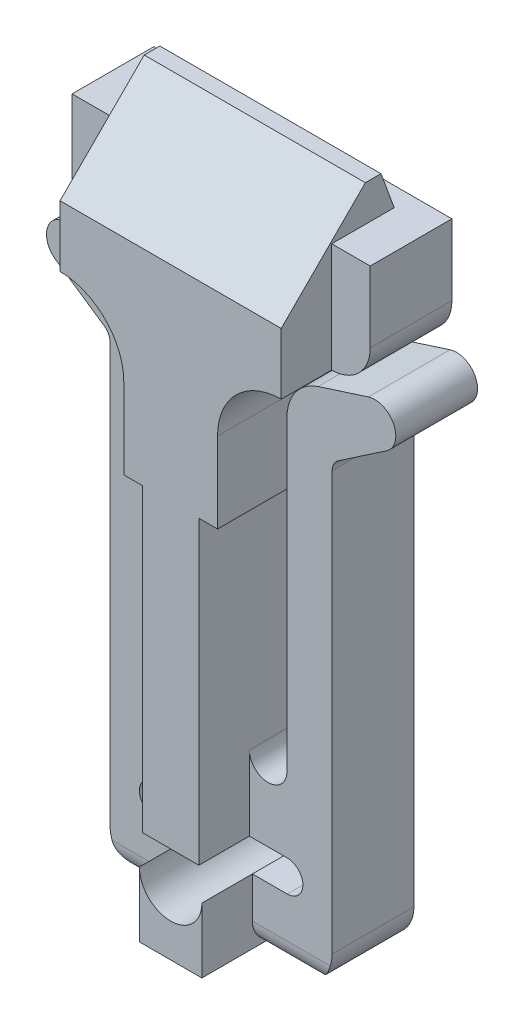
ISO-10303-21;
HEADER;
FILE_DESCRIPTION(('STEP AP214'),'2;1');
FILE_NAME('part.step','',(''),(''),'','','');
FILE_SCHEMA(('AUTOMOTIVE_DESIGN { 1 0 10303 214 1 1 1 1 }'));
ENDSEC;
DATA;
#1=APPLICATION_CONTEXT('core data for automotive mechanical design processes');
#2=APPLICATION_PROTOCOL_DEFINITION('international standard','automotive_design',2000,#1);
#3=PRODUCT_CONTEXT('',#1,'mechanical');
#4=PRODUCT('Part','Part','',(#3));
#5=PRODUCT_RELATED_PRODUCT_CATEGORY('part','',(#4));
#6=PRODUCT_DEFINITION_FORMATION('','',#4);
#7=PRODUCT_DEFINITION_CONTEXT('part definition',#1,'design');
#8=PRODUCT_DEFINITION('design','',#6,#7);
#9=PRODUCT_DEFINITION_SHAPE('','',#8);
#10=(LENGTH_UNIT() NAMED_UNIT(*) SI_UNIT(.MILLI.,.METRE.));
#11=(NAMED_UNIT(*) PLANE_ANGLE_UNIT() SI_UNIT($,.RADIAN.));
#12=(NAMED_UNIT(*) SI_UNIT($,.STERADIAN.) SOLID_ANGLE_UNIT());
#13=UNCERTAINTY_MEASURE_WITH_UNIT(LENGTH_MEASURE(1.E-05),#10,'distance_accuracy_value','');
#14=(GEOMETRIC_REPRESENTATION_CONTEXT(3) GLOBAL_UNCERTAINTY_ASSIGNED_CONTEXT((#13)) GLOBAL_UNIT_ASSIGNED_CONTEXT((#10,
#11,#12)) REPRESENTATION_CONTEXT('',''));
#15=CARTESIAN_POINT('',(0.,0.,0.));
#16=DIRECTION('',(0.,0.,1.));
#17=DIRECTION('',(1.,0.,0.));
#18=AXIS2_PLACEMENT_3D('',#15,#16,#17);
#19=CARTESIAN_POINT('',(0.,-3.,2.4));
#20=DIRECTION('',(1.,0.,0.));
#21=DIRECTION('',(0.,0.,-1.));
#22=AXIS2_PLACEMENT_3D('',#19,#20,#21);
#23=CYLINDRICAL_SURFACE('',#22,1.);
#24=CARTESIAN_POINT('',(-0.125,-3.,2.4));
#25=DIRECTION('',(1.,0.,0.));
#26=DIRECTION('',(0.,1.,0.));
#27=AXIS2_PLACEMENT_3D('',#24,#25,#26);
#28=CIRCLE('',#27,1.);
#29=CARTESIAN_POINT('',(-0.125,-3.,3.4));
#30=VERTEX_POINT('',#29);
#31=CARTESIAN_POINT('',(-0.125,-4.,2.4));
#32=VERTEX_POINT('',#31);
#33=EDGE_CURVE('E10',#30,#32,#28,.T.);
#34=ORIENTED_EDGE('',*,*,#33,.F.);
#35=DIRECTION('',(1.,0.,0.));
#36=VECTOR('',#35,1.);
#37=CARTESIAN_POINT('',(-0.125,-3.,3.4));
#38=LINE('',#37,#36);
#39=CARTESIAN_POINT('',(-3.36612312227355,-3.,3.4));
#40=VERTEX_POINT('',#39);
#41=EDGE_CURVE('E780',#40,#30,#38,.T.);
#42=ORIENTED_EDGE('',*,*,#41,.F.);
#43=CARTESIAN_POINT('',(-3.36612312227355,-3.,3.4));
#44=CARTESIAN_POINT('',(-3.35664906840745,-3.02795051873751,3.40000256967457));
#45=CARTESIAN_POINT('',(-3.34633379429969,-3.05558881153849,3.39882811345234));
#46=CARTESIAN_POINT('',(-3.3241544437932,-3.11000766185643,3.39430454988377));
#47=CARTESIAN_POINT('',(-3.31229272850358,-3.13678945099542,3.39095872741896));
#48=CARTESIAN_POINT('',(-3.27481006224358,-3.21506444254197,3.3780197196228));
#49=CARTESIAN_POINT('',(-3.24708387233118,-3.26509219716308,3.36551702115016));
#50=CARTESIAN_POINT('',(-3.18047615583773,-3.37073084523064,3.33075723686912));
#51=CARTESIAN_POINT('',(-3.14048486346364,-3.42511188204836,3.30694991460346));
#52=CARTESIAN_POINT('',(-3.05546740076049,-3.52612642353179,3.25235272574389));
#53=CARTESIAN_POINT('',(-3.01041974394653,-3.57272459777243,3.22153244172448));
#54=CARTESIAN_POINT('',(-2.89878857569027,-3.67451548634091,3.14206242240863));
#55=CARTESIAN_POINT('',(-2.830585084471,-3.72612226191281,3.09111405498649));
#56=CARTESIAN_POINT('',(-2.68999294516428,-3.81534504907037,2.98320087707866));
#57=CARTESIAN_POINT('',(-2.61759817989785,-3.85293998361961,2.92622716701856));
#58=CARTESIAN_POINT('',(-2.45184101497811,-3.92291481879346,2.79389174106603));
#59=CARTESIAN_POINT('',(-2.35776697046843,-3.95163247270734,2.71749758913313));
#60=CARTESIAN_POINT('',(-2.1680711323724,-3.98995674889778,2.56232671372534));
#61=CARTESIAN_POINT('',(-2.07245312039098,-3.99960451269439,2.48355549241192));
#62=CARTESIAN_POINT('',(-1.97498903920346,-3.99999601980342,2.40325408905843));
#63=CARTESIAN_POINT('',(-1.97301422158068,-3.9999999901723,2.40162701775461));
#64=CARTESIAN_POINT('',(-1.97103946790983,-4.,2.4));
#65=B_SPLINE_CURVE_WITH_KNOTS('',3,(#43,#44,#45,#46,#47,#48,#49,#50,#51,#52,#53,#54,#55,#56,#57,
#58,#59,#60,#61,#62,#63,#64),.UNSPECIFIED.,.F.,.F.,(4,2,2,2,2,2,2,2,2,2,4),(0.,
0.0884578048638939,0.176782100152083,0.351541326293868,0.565136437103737,0.779676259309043,
1.07671809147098,1.37420495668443,1.74617255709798,2.11733679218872,2.12501307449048),.UNSPECIFIED.);
#66=CARTESIAN_POINT('',(-1.97103946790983,-4.,2.4));
#67=VERTEX_POINT('',#66);
#68=EDGE_CURVE('E20',#67,#40,#65,.F.);
#69=ORIENTED_EDGE('',*,*,#68,.F.);
#70=DIRECTION('',(-1.,0.,0.));
#71=VECTOR('',#70,1.);
#72=CARTESIAN_POINT('',(-1.97103946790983,-4.,2.4));
#73=LINE('',#72,#71);
#74=EDGE_CURVE('E145',#32,#67,#73,.T.);
#75=ORIENTED_EDGE('',*,*,#74,.F.);
#76=EDGE_LOOP('',(#34,#42,#69,#75));
#77=FACE_BOUND('',#76,.T.);
#78=ADVANCED_FACE('F16',(#77),#23,.T.);
#79=CARTESIAN_POINT('',(0.,-3.,2.4));
#80=DIRECTION('',(1.,0.,0.));
#81=DIRECTION('',(0.,0.,-1.));
#82=AXIS2_PLACEMENT_3D('',#79,#80,#81);
#83=CYLINDRICAL_SURFACE('',#82,1.);
#84=CARTESIAN_POINT('',(5.71612312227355,-3.,3.4));
#85=CARTESIAN_POINT('',(5.70664906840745,-3.02795051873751,3.40000256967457));
#86=CARTESIAN_POINT('',(5.69633379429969,-3.05558881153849,3.39882811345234));
#87=CARTESIAN_POINT('',(5.67415444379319,-3.11000766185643,3.39430454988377));
#88=CARTESIAN_POINT('',(5.66229272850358,-3.13678945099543,3.39095872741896));
#89=CARTESIAN_POINT('',(5.62481006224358,-3.21506444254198,3.3780197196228));
#90=CARTESIAN_POINT('',(5.59708387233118,-3.26509219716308,3.36551702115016));
#91=CARTESIAN_POINT('',(5.53047615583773,-3.37073084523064,3.33075723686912));
#92=CARTESIAN_POINT('',(5.49048486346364,-3.42511188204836,3.30694991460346));
#93=CARTESIAN_POINT('',(5.40546740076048,-3.52612642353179,3.25235272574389));
#94=CARTESIAN_POINT('',(5.36041974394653,-3.57272459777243,3.22153244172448));
#95=CARTESIAN_POINT('',(5.24878857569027,-3.67451548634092,3.14206242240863));
#96=CARTESIAN_POINT('',(5.180585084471,-3.72612226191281,3.09111405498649));
#97=CARTESIAN_POINT('',(5.03999294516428,-3.81534504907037,2.98320087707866));
#98=CARTESIAN_POINT('',(4.96759817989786,-3.85293998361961,2.92622716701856));
#99=CARTESIAN_POINT('',(4.80184101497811,-3.92291481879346,2.79389174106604));
#100=CARTESIAN_POINT('',(4.70776697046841,-3.95163247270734,2.71749758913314));
#101=CARTESIAN_POINT('',(4.51807113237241,-3.98995674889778,2.56232671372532));
#102=CARTESIAN_POINT('',(4.42245312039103,-3.99960451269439,2.48355549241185));
#103=CARTESIAN_POINT('',(4.32498903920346,-3.99999601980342,2.40325408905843));
#104=CARTESIAN_POINT('',(4.32301422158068,-3.9999999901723,2.4016270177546));
#105=CARTESIAN_POINT('',(4.32103946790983,-4.,2.4));
#106=B_SPLINE_CURVE_WITH_KNOTS('',3,(#84,#85,#86,#87,#88,#89,#90,#91,#92,#93,#94,#95,#96,#97,
#98,#99,#100,#101,#102,#103,#104,#105),.UNSPECIFIED.,.F.,.F.,(4,2,2,2,2,2,2,2,2,2,4),(0.,
0.0884578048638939,0.176782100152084,0.351541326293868,0.565136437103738,0.779676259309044,
1.07671809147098,1.37420495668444,1.74617255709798,2.11733679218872,2.12501307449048),.UNSPECIFIED.);
#107=CARTESIAN_POINT('',(5.71612312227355,-3.,3.4));
#108=VERTEX_POINT('',#107);
#109=CARTESIAN_POINT('',(4.32103946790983,-4.,2.4));
#110=VERTEX_POINT('',#109);
#111=EDGE_CURVE('E681',#108,#110,#106,.T.);
#112=ORIENTED_EDGE('',*,*,#111,.F.);
#113=DIRECTION('',(1.,0.,0.));
#114=VECTOR('',#113,1.);
#115=CARTESIAN_POINT('',(4.32103946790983,-3.,3.4));
#116=LINE('',#115,#114);
#117=CARTESIAN_POINT('',(2.475,-3.,3.4));
#118=VERTEX_POINT('',#117);
#119=EDGE_CURVE('E765',#118,#108,#116,.T.);
#120=ORIENTED_EDGE('',*,*,#119,.F.);
#121=CARTESIAN_POINT('',(2.475,-3.,2.4));
#122=DIRECTION('',(-1.,0.,0.));
#123=DIRECTION('',(0.,0.,1.));
#124=AXIS2_PLACEMENT_3D('',#121,#122,#123);
#125=CIRCLE('',#124,1.);
#126=CARTESIAN_POINT('',(2.475,-4.,2.4));
#127=VERTEX_POINT('',#126);
#128=EDGE_CURVE('E582',#127,#118,#125,.T.);
#129=ORIENTED_EDGE('',*,*,#128,.F.);
#130=DIRECTION('',(-1.,0.,0.));
#131=VECTOR('',#130,1.);
#132=CARTESIAN_POINT('',(2.475,-4.,2.4));
#133=LINE('',#132,#131);
#134=EDGE_CURVE('E673',#110,#127,#133,.T.);
#135=ORIENTED_EDGE('',*,*,#134,.F.);
#136=EDGE_LOOP('',(#112,#120,#129,#135));
#137=FACE_BOUND('',#136,.T.);
#138=ADVANCED_FACE('F799',(#137),#83,.T.);
#139=CARTESIAN_POINT('',(0.,0.,5.5));
#140=DIRECTION('',(0.,0.,1.));
#141=DIRECTION('',(1.,0.,0.));
#142=AXIS2_PLACEMENT_3D('',#139,#140,#141);
#143=PLANE('',#142);
#144=DIRECTION('',(0.,-1.,0.));
#145=VECTOR('',#144,1.);
#146=CARTESIAN_POINT('',(-0.125,0.,5.5));
#147=LINE('',#146,#145);
#148=CARTESIAN_POINT('',(-0.125,-1.3,5.5));
#149=VERTEX_POINT('',#148);
#150=CARTESIAN_POINT('',(-0.125,-4.,5.5));
#151=VERTEX_POINT('',#150);
#152=EDGE_CURVE('E32',#149,#151,#147,.T.);
#153=ORIENTED_EDGE('',*,*,#152,.T.);
#154=DIRECTION('',(1.,0.,0.));
#155=VECTOR('',#154,1.);
#156=CARTESIAN_POINT('',(0.,-4.,5.5));
#157=LINE('',#156,#155);
#158=CARTESIAN_POINT('',(2.475,-4.,5.5));
#159=VERTEX_POINT('',#158);
#160=EDGE_CURVE('E672',#151,#159,#157,.T.);
#161=ORIENTED_EDGE('',*,*,#160,.T.);
#162=DIRECTION('',(0.,1.,0.));
#163=VECTOR('',#162,1.);
#164=CARTESIAN_POINT('',(2.475,0.,5.5));
#165=LINE('',#164,#163);
#166=CARTESIAN_POINT('',(2.475,-1.3,5.5));
#167=VERTEX_POINT('',#166);
#168=EDGE_CURVE('E47',#159,#167,#165,.T.);
#169=ORIENTED_EDGE('',*,*,#168,.T.);
#170=CARTESIAN_POINT('',(1.175,-1.3,5.5));
#171=DIRECTION('',(0.,0.,-1.));
#172=DIRECTION('',(1.,0.,0.));
#173=AXIS2_PLACEMENT_3D('',#170,#171,#172);
#174=CIRCLE('',#173,1.3);
#175=EDGE_CURVE('E747',#167,#149,#174,.T.);
#176=ORIENTED_EDGE('',*,*,#175,.T.);
#177=EDGE_LOOP('',(#153,#161,#169,#176));
#178=FACE_BOUND('',#177,.T.);
#179=ADVANCED_FACE('F803',(#178),#143,.T.);
#180=CARTESIAN_POINT('',(-0.125,0.,9.24833296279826));
#181=DIRECTION('',(1.,0.,0.));
#182=DIRECTION('',(0.,1.,0.));
#183=AXIS2_PLACEMENT_3D('',#180,#181,#182);
#184=PLANE('',#183);
#185=ORIENTED_EDGE('',*,*,#152,.F.);
#186=DIRECTION('',(0.,0.,-1.));
#187=VECTOR('',#186,1.);
#188=CARTESIAN_POINT('',(-0.125,-1.3,9.24833296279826));
#189=LINE('',#188,#187);
#190=CARTESIAN_POINT('',(-0.125,-1.3,3.4));
#191=VERTEX_POINT('',#190);
#192=EDGE_CURVE('E746',#149,#191,#189,.T.);
#193=ORIENTED_EDGE('',*,*,#192,.T.);
#194=DIRECTION('',(0.,-1.,0.));
#195=VECTOR('',#194,1.);
#196=CARTESIAN_POINT('',(-0.125,0.,3.4));
#197=LINE('',#196,#195);
#198=EDGE_CURVE('E784',#191,#30,#197,.T.);
#199=ORIENTED_EDGE('',*,*,#198,.T.);
#200=ORIENTED_EDGE('',*,*,#33,.T.);
#201=DIRECTION('',(0.,0.,-1.));
#202=VECTOR('',#201,1.);
#203=CARTESIAN_POINT('',(-0.125,-4.,9.24833296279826));
#204=LINE('',#203,#202);
#205=EDGE_CURVE('E674',#151,#32,#204,.T.);
#206=ORIENTED_EDGE('',*,*,#205,.F.);
#207=EDGE_LOOP('',(#185,#193,#199,#200,#206));
#208=FACE_BOUND('',#207,.T.);
#209=ADVANCED_FACE('F807',(#208),#184,.F.);
#210=CARTESIAN_POINT('',(2.475,0.,9.24833296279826));
#211=DIRECTION('',(-1.,0.,0.));
#212=DIRECTION('',(0.,0.,1.));
#213=AXIS2_PLACEMENT_3D('',#210,#211,#212);
#214=PLANE('',#213);
#215=ORIENTED_EDGE('',*,*,#168,.F.);
#216=DIRECTION('',(0.,0.,-1.));
#217=VECTOR('',#216,1.);
#218=CARTESIAN_POINT('',(2.475,-4.,9.24833296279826));
#219=LINE('',#218,#217);
#220=EDGE_CURVE('E668',#159,#127,#219,.T.);
#221=ORIENTED_EDGE('',*,*,#220,.T.);
#222=ORIENTED_EDGE('',*,*,#128,.T.);
#223=DIRECTION('',(0.,1.,0.));
#224=VECTOR('',#223,1.);
#225=CARTESIAN_POINT('',(2.475,0.,3.4));
#226=LINE('',#225,#224);
#227=CARTESIAN_POINT('',(2.475,-1.3,3.4));
#228=VERTEX_POINT('',#227);
#229=EDGE_CURVE('E769',#118,#228,#226,.T.);
#230=ORIENTED_EDGE('',*,*,#229,.T.);
#231=DIRECTION('',(0.,0.,-1.));
#232=VECTOR('',#231,1.);
#233=CARTESIAN_POINT('',(2.475,-1.3,9.24833296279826));
#234=LINE('',#233,#232);
#235=EDGE_CURVE('E750',#167,#228,#234,.T.);
#236=ORIENTED_EDGE('',*,*,#235,.F.);
#237=EDGE_LOOP('',(#215,#221,#222,#230,#236));
#238=FACE_BOUND('',#237,.T.);
#239=ADVANCED_FACE('F810',(#238),#214,.F.);
#240=CARTESIAN_POINT('',(-1.575,-0.65,0.));
#241=DIRECTION('',(0.,0.,1.));
#242=DIRECTION('',(1.,0.,0.));
#243=AXIS2_PLACEMENT_3D('',#240,#241,#242);
#244=CYLINDRICAL_SURFACE('',#243,0.65);
#245=CARTESIAN_POINT('',(-1.575,-0.65,3.4));
#246=DIRECTION('',(0.,0.,1.));
#247=DIRECTION('',(1.,0.,0.));
#248=AXIS2_PLACEMENT_3D('',#245,#246,#247);
#249=CIRCLE('',#248,0.65);
#250=CARTESIAN_POINT('',(-1.575,0.,3.4));
#251=VERTEX_POINT('',#250);
#252=CARTESIAN_POINT('',(-1.575,-1.3,3.4));
#253=VERTEX_POINT('',#252);
#254=EDGE_CURVE('E2075',#251,#253,#249,.T.);
#255=ORIENTED_EDGE('',*,*,#254,.T.);
#256=DIRECTION('',(0.,0.,1.));
#257=VECTOR('',#256,1.);
#258=CARTESIAN_POINT('',(-1.575,-1.3,0.));
#259=LINE('',#258,#257);
#260=CARTESIAN_POINT('',(-1.575,-1.3,0.));
#261=VERTEX_POINT('',#260);
#262=EDGE_CURVE('E583',#261,#253,#259,.T.);
#263=ORIENTED_EDGE('',*,*,#262,.F.);
#264=CARTESIAN_POINT('',(-1.575,-0.65,0.));
#265=DIRECTION('',(0.,0.,1.));
#266=DIRECTION('',(1.,0.,0.));
#267=AXIS2_PLACEMENT_3D('',#264,#265,#266);
#268=CIRCLE('',#267,0.65);
#269=CARTESIAN_POINT('',(-1.575,0.,0.));
#270=VERTEX_POINT('',#269);
#271=EDGE_CURVE('E555',#270,#261,#268,.T.);
#272=ORIENTED_EDGE('',*,*,#271,.F.);
#273=DIRECTION('',(0.,0.,1.));
#274=VECTOR('',#273,1.);
#275=CARTESIAN_POINT('',(-1.575,0.,0.));
#276=LINE('',#275,#274);
#277=EDGE_CURVE('E576',#270,#251,#276,.T.);
#278=ORIENTED_EDGE('',*,*,#277,.T.);
#279=EDGE_LOOP('',(#255,#263,#272,#278));
#280=FACE_BOUND('',#279,.T.);
#281=ADVANCED_FACE('F812',(#280),#244,.F.);
#282=CARTESIAN_POINT('',(0.,-1.3,0.));
#283=DIRECTION('',(0.,-1.,0.));
#284=DIRECTION('',(0.,0.,-1.));
#285=AXIS2_PLACEMENT_3D('',#282,#283,#284);
#286=PLANE('',#285);
#287=DIRECTION('',(1.,0.,0.));
#288=VECTOR('',#287,1.);
#289=CARTESIAN_POINT('',(0.,-1.3,3.4));
#290=LINE('',#289,#288);
#291=EDGE_CURVE('E897',#253,#191,#290,.T.);
#292=ORIENTED_EDGE('',*,*,#291,.T.);
#293=DIRECTION('',(0.,0.,1.));
#294=VECTOR('',#293,1.);
#295=CARTESIAN_POINT('',(-0.125,-1.3,0.));
#296=LINE('',#295,#294);
#297=CARTESIAN_POINT('',(-0.125,-1.3,0.));
#298=VERTEX_POINT('',#297);
#299=EDGE_CURVE('E742',#298,#191,#296,.T.);
#300=ORIENTED_EDGE('',*,*,#299,.F.);
#301=DIRECTION('',(1.,0.,0.));
#302=VECTOR('',#301,1.);
#303=CARTESIAN_POINT('',(0.,-1.3,0.));
#304=LINE('',#303,#302);
#305=EDGE_CURVE('E550',#261,#298,#304,.T.);
#306=ORIENTED_EDGE('',*,*,#305,.F.);
#307=ORIENTED_EDGE('',*,*,#262,.T.);
#308=EDGE_LOOP('',(#292,#300,#306,#307));
#309=FACE_BOUND('',#308,.T.);
#310=ADVANCED_FACE('F815',(#309),#286,.F.);
#311=CARTESIAN_POINT('',(1.175,-1.3,0.));
#312=DIRECTION('',(0.,0.,1.));
#313=DIRECTION('',(1.,0.,0.));
#314=AXIS2_PLACEMENT_3D('',#311,#312,#313);
#315=CYLINDRICAL_SURFACE('',#314,1.3);
#316=ORIENTED_EDGE('',*,*,#299,.T.);
#317=ORIENTED_EDGE('',*,*,#192,.F.);
#318=ORIENTED_EDGE('',*,*,#175,.F.);
#319=ORIENTED_EDGE('',*,*,#235,.T.);
#320=DIRECTION('',(0.,0.,1.));
#321=VECTOR('',#320,1.);
#322=CARTESIAN_POINT('',(2.475,-1.3,0.));
#323=LINE('',#322,#321);
#324=CARTESIAN_POINT('',(2.475,-1.3,0.));
#325=VERTEX_POINT('',#324);
#326=EDGE_CURVE('E738',#325,#228,#323,.T.);
#327=ORIENTED_EDGE('',*,*,#326,.F.);
#328=CARTESIAN_POINT('',(1.175,-1.3,0.));
#329=DIRECTION('',(0.,0.,1.));
#330=DIRECTION('',(1.,0.,0.));
#331=AXIS2_PLACEMENT_3D('',#328,#329,#330);
#332=CIRCLE('',#331,1.3);
#333=EDGE_CURVE('E554',#298,#325,#332,.T.);
#334=ORIENTED_EDGE('',*,*,#333,.F.);
#335=EDGE_LOOP('',(#316,#317,#318,#319,#327,#334));
#336=FACE_BOUND('',#335,.T.);
#337=ADVANCED_FACE('F819',(#336),#315,.F.);
#338=CARTESIAN_POINT('',(0.,-1.3,0.));
#339=DIRECTION('',(0.,-1.,0.));
#340=DIRECTION('',(0.,0.,-1.));
#341=AXIS2_PLACEMENT_3D('',#338,#339,#340);
#342=PLANE('',#341);
#343=DIRECTION('',(1.,0.,0.));
#344=VECTOR('',#343,1.);
#345=CARTESIAN_POINT('',(0.,-1.3,3.4));
#346=LINE('',#345,#344);
#347=CARTESIAN_POINT('',(3.925,-1.3,3.4));
#348=VERTEX_POINT('',#347);
#349=EDGE_CURVE('E788',#228,#348,#346,.T.);
#350=ORIENTED_EDGE('',*,*,#349,.T.);
#351=DIRECTION('',(0.,0.,1.));
#352=VECTOR('',#351,1.);
#353=CARTESIAN_POINT('',(3.925,-1.3,0.));
#354=LINE('',#353,#352);
#355=CARTESIAN_POINT('',(3.925,-1.3,0.));
#356=VERTEX_POINT('',#355);
#357=EDGE_CURVE('E734',#356,#348,#354,.T.);
#358=ORIENTED_EDGE('',*,*,#357,.F.);
#359=DIRECTION('',(1.,0.,0.));
#360=VECTOR('',#359,1.);
#361=CARTESIAN_POINT('',(0.,-1.3,0.));
#362=LINE('',#361,#360);
#363=EDGE_CURVE('E559',#325,#356,#362,.T.);
#364=ORIENTED_EDGE('',*,*,#363,.F.);
#365=ORIENTED_EDGE('',*,*,#326,.T.);
#366=EDGE_LOOP('',(#350,#358,#364,#365));
#367=FACE_BOUND('',#366,.T.);
#368=ADVANCED_FACE('F823',(#367),#342,.F.);
#369=CARTESIAN_POINT('',(-3.42500011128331,20.1,3.4));
#370=DIRECTION('',(0.,0.,-1.));
#371=DIRECTION('',(0.,-1.,0.));
#372=AXIS2_PLACEMENT_3D('',#369,#370,#371);
#373=PLANE('',#372);
#374=DIRECTION('',(0.,1.,0.));
#375=VECTOR('',#374,1.);
#376=CARTESIAN_POINT('',(-5.02500011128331,20.1,3.4));
#377=LINE('',#376,#375);
#378=CARTESIAN_POINT('',(-5.02500011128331,20.1,3.4));
#379=VERTEX_POINT('',#378);
#380=CARTESIAN_POINT('',(-5.02500011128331,23.05,3.4));
#381=VERTEX_POINT('',#380);
#382=EDGE_CURVE('E728',#379,#381,#377,.T.);
#383=ORIENTED_EDGE('',*,*,#382,.F.);
#384=CARTESIAN_POINT('',(-3.42500011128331,20.1,3.4));
#385=DIRECTION('',(0.,0.,-1.));
#386=DIRECTION('',(-1.,0.,0.));
#387=AXIS2_PLACEMENT_3D('',#384,#385,#386);
#388=CIRCLE('',#387,1.6);
#389=CARTESIAN_POINT('',(-3.42500011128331,18.5,3.4));
#390=VERTEX_POINT('',#389);
#391=EDGE_CURVE('E731',#390,#379,#388,.T.);
#392=ORIENTED_EDGE('',*,*,#391,.F.);
#393=DIRECTION('',(0.,-1.,0.));
#394=VECTOR('',#393,1.);
#395=CARTESIAN_POINT('',(-3.42500011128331,23.05,3.4));
#396=LINE('',#395,#394);
#397=CARTESIAN_POINT('',(-3.42500011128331,23.05,3.4));
#398=VERTEX_POINT('',#397);
#399=EDGE_CURVE('E603',#398,#390,#396,.T.);
#400=ORIENTED_EDGE('',*,*,#399,.F.);
#401=DIRECTION('',(1.,0.,0.));
#402=VECTOR('',#401,1.);
#403=CARTESIAN_POINT('',(-5.02500011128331,23.05,3.4));
#404=LINE('',#403,#402);
#405=EDGE_CURVE('E706',#381,#398,#404,.T.);
#406=ORIENTED_EDGE('',*,*,#405,.F.);
#407=EDGE_LOOP('',(#383,#392,#400,#406));
#408=FACE_BOUND('',#407,.T.);
#409=ADVANCED_FACE('F827',(#408),#373,.F.);
#410=CARTESIAN_POINT('',(-3.42500011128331,20.1,3.4));
#411=DIRECTION('',(0.,0.,-1.));
#412=DIRECTION('',(-1.,0.,0.));
#413=AXIS2_PLACEMENT_3D('',#410,#411,#412);
#414=CYLINDRICAL_SURFACE('',#413,1.6);
#415=CARTESIAN_POINT('',(-3.42500011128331,20.1,0.));
#416=DIRECTION('',(0.,0.,-1.));
#417=DIRECTION('',(-1.,0.,0.));
#418=AXIS2_PLACEMENT_3D('',#415,#416,#417);
#419=CIRCLE('',#418,1.6);
#420=CARTESIAN_POINT('',(-3.42500011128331,18.5,0.));
#421=VERTEX_POINT('',#420);
#422=CARTESIAN_POINT('',(-5.02500011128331,20.1,0.));
#423=VERTEX_POINT('',#422);
#424=EDGE_CURVE('E542',#421,#423,#419,.T.);
#425=ORIENTED_EDGE('',*,*,#424,.F.);
#426=DIRECTION('',(0.,0.,-1.));
#427=VECTOR('',#426,1.);
#428=CARTESIAN_POINT('',(-3.42500011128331,18.5,3.4));
#429=LINE('',#428,#427);
#430=EDGE_CURVE('E637',#390,#421,#429,.T.);
#431=ORIENTED_EDGE('',*,*,#430,.F.);
#432=ORIENTED_EDGE('',*,*,#391,.T.);
#433=DIRECTION('',(0.,0.,-1.));
#434=VECTOR('',#433,1.);
#435=CARTESIAN_POINT('',(-5.02500011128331,20.1,3.4));
#436=LINE('',#435,#434);
#437=EDGE_CURVE('E725',#379,#423,#436,.T.);
#438=ORIENTED_EDGE('',*,*,#437,.T.);
#439=EDGE_LOOP('',(#425,#431,#432,#438));
#440=FACE_BOUND('',#439,.T.);
#441=ADVANCED_FACE('F829',(#440),#414,.T.);
#442=CARTESIAN_POINT('',(-5.02500011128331,20.1,3.4));
#443=DIRECTION('',(-1.,0.,0.));
#444=DIRECTION('',(0.,0.,1.));
#445=AXIS2_PLACEMENT_3D('',#442,#443,#444);
#446=PLANE('',#445);
#447=DIRECTION('',(0.,1.,0.));
#448=VECTOR('',#447,1.);
#449=CARTESIAN_POINT('',(-5.02500011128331,20.1,0.));
#450=LINE('',#449,#448);
#451=CARTESIAN_POINT('',(-5.02500011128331,23.05,0.));
#452=VERTEX_POINT('',#451);
#453=EDGE_CURVE('E546',#423,#452,#450,.T.);
#454=ORIENTED_EDGE('',*,*,#453,.F.);
#455=ORIENTED_EDGE('',*,*,#437,.F.);
#456=ORIENTED_EDGE('',*,*,#382,.T.);
#457=DIRECTION('',(0.,0.,-1.));
#458=VECTOR('',#457,1.);
#459=CARTESIAN_POINT('',(-5.02500011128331,23.05,3.4));
#460=LINE('',#459,#458);
#461=EDGE_CURVE('E703',#381,#452,#460,.T.);
#462=ORIENTED_EDGE('',*,*,#461,.T.);
#463=EDGE_LOOP('',(#454,#455,#456,#462));
#464=FACE_BOUND('',#463,.T.);
#465=ADVANCED_FACE('F832',(#464),#446,.T.);
#466=CARTESIAN_POINT('',(5.77499988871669,20.1,3.4));
#467=DIRECTION('',(0.,0.,1.));
#468=DIRECTION('',(1.,0.,0.));
#469=AXIS2_PLACEMENT_3D('',#466,#467,#468);
#470=PLANE('',#469);
#471=CARTESIAN_POINT('',(5.77499988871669,20.1,3.4));
#472=DIRECTION('',(0.,0.,-1.));
#473=DIRECTION('',(1.,0.,0.));
#474=AXIS2_PLACEMENT_3D('',#471,#472,#473);
#475=CIRCLE('',#474,1.6);
#476=CARTESIAN_POINT('',(7.37499988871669,20.1,3.4));
#477=VERTEX_POINT('',#476);
#478=CARTESIAN_POINT('',(5.77499988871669,18.5,3.4));
#479=VERTEX_POINT('',#478);
#480=EDGE_CURVE('E719',#477,#479,#475,.T.);
#481=ORIENTED_EDGE('',*,*,#480,.F.);
#482=DIRECTION('',(0.,-1.,0.));
#483=VECTOR('',#482,1.);
#484=CARTESIAN_POINT('',(7.37499988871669,20.1,3.4));
#485=LINE('',#484,#483);
#486=CARTESIAN_POINT('',(7.37499988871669,23.05,3.4));
#487=VERTEX_POINT('',#486);
#488=EDGE_CURVE('E722',#487,#477,#485,.T.);
#489=ORIENTED_EDGE('',*,*,#488,.F.);
#490=DIRECTION('',(1.,0.,0.));
#491=VECTOR('',#490,1.);
#492=CARTESIAN_POINT('',(7.37499988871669,23.05,3.4));
#493=LINE('',#492,#491);
#494=CARTESIAN_POINT('',(5.77499988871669,23.05,3.4));
#495=VERTEX_POINT('',#494);
#496=EDGE_CURVE('E709',#495,#487,#493,.T.);
#497=ORIENTED_EDGE('',*,*,#496,.F.);
#498=DIRECTION('',(0.,1.,0.));
#499=VECTOR('',#498,1.);
#500=CARTESIAN_POINT('',(5.77499988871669,23.05,3.4));
#501=LINE('',#500,#499);
#502=EDGE_CURVE('E594',#479,#495,#501,.T.);
#503=ORIENTED_EDGE('',*,*,#502,.F.);
#504=EDGE_LOOP('',(#481,#489,#497,#503));
#505=FACE_BOUND('',#504,.T.);
#506=ADVANCED_FACE('F836',(#505),#470,.T.);
#507=CARTESIAN_POINT('',(7.37499988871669,20.1,3.4));
#508=DIRECTION('',(1.,0.,0.));
#509=DIRECTION('',(0.,1.,0.));
#510=AXIS2_PLACEMENT_3D('',#507,#508,#509);
#511=PLANE('',#510);
#512=DIRECTION('',(0.,-1.,0.));
#513=VECTOR('',#512,1.);
#514=CARTESIAN_POINT('',(7.37499988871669,20.1,0.));
#515=LINE('',#514,#513);
#516=CARTESIAN_POINT('',(7.37499988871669,23.05,0.));
#517=VERTEX_POINT('',#516);
#518=CARTESIAN_POINT('',(7.37499988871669,20.1,0.));
#519=VERTEX_POINT('',#518);
#520=EDGE_CURVE('E1965',#517,#519,#515,.T.);
#521=ORIENTED_EDGE('',*,*,#520,.F.);
#522=DIRECTION('',(0.,0.,-1.));
#523=VECTOR('',#522,1.);
#524=CARTESIAN_POINT('',(7.37499988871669,23.05,3.4));
#525=LINE('',#524,#523);
#526=EDGE_CURVE('E713',#487,#517,#525,.T.);
#527=ORIENTED_EDGE('',*,*,#526,.F.);
#528=ORIENTED_EDGE('',*,*,#488,.T.);
#529=DIRECTION('',(0.,0.,-1.));
#530=VECTOR('',#529,1.);
#531=CARTESIAN_POINT('',(7.37499988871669,20.1,3.4));
#532=LINE('',#531,#530);
#533=EDGE_CURVE('E716',#477,#519,#532,.T.);
#534=ORIENTED_EDGE('',*,*,#533,.T.);
#535=EDGE_LOOP('',(#521,#527,#528,#534));
#536=FACE_BOUND('',#535,.T.);
#537=ADVANCED_FACE('F840',(#536),#511,.T.);
#538=CARTESIAN_POINT('',(5.77499988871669,20.1,3.4));
#539=DIRECTION('',(0.,0.,-1.));
#540=DIRECTION('',(-1.,0.,0.));
#541=AXIS2_PLACEMENT_3D('',#538,#539,#540);
#542=CYLINDRICAL_SURFACE('',#541,1.6);
#543=CARTESIAN_POINT('',(5.77499988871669,20.1,0.));
#544=DIRECTION('',(0.,0.,-1.));
#545=DIRECTION('',(1.,0.,0.));
#546=AXIS2_PLACEMENT_3D('',#543,#544,#545);
#547=CIRCLE('',#546,1.6);
#548=CARTESIAN_POINT('',(5.77499988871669,18.5,0.));
#549=VERTEX_POINT('',#548);
#550=EDGE_CURVE('E1966',#519,#549,#547,.T.);
#551=ORIENTED_EDGE('',*,*,#550,.F.);
#552=ORIENTED_EDGE('',*,*,#533,.F.);
#553=ORIENTED_EDGE('',*,*,#480,.T.);
#554=DIRECTION('',(0.,0.,-1.));
#555=VECTOR('',#554,1.);
#556=CARTESIAN_POINT('',(5.77499988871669,18.5,3.4));
#557=LINE('',#556,#555);
#558=EDGE_CURVE('E653',#479,#549,#557,.T.);
#559=ORIENTED_EDGE('',*,*,#558,.T.);
#560=EDGE_LOOP('',(#551,#552,#553,#559));
#561=FACE_BOUND('',#560,.T.);
#562=ADVANCED_FACE('F842',(#561),#542,.T.);
#563=CARTESIAN_POINT('',(8.44107808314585,13.275,13.275));
#564=DIRECTION('',(0.,-0.707106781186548,-0.707106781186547));
#565=DIRECTION('',(0.,0.707106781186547,-0.707106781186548));
#566=AXIS2_PLACEMENT_3D('',#563,#564,#565);
#567=PLANE('',#566);
#568=DIRECTION('',(0.,0.707106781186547,-0.707106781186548));
#569=VECTOR('',#568,1.);
#570=CARTESIAN_POINT('',(5.7749998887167,10.525,16.025));
#571=LINE('',#570,#569);
#572=CARTESIAN_POINT('',(5.77499988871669,21.05,5.5));
#573=VERTEX_POINT('',#572);
#574=CARTESIAN_POINT('',(5.77499988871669,24.55,2.));
#575=VERTEX_POINT('',#574);
#576=EDGE_CURVE('E586',#573,#575,#571,.T.);
#577=ORIENTED_EDGE('',*,*,#576,.T.);
#578=DIRECTION('',(-1.,0.,0.));
#579=VECTOR('',#578,1.);
#580=CARTESIAN_POINT('',(8.44107808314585,24.55,2.));
#581=LINE('',#580,#579);
#582=CARTESIAN_POINT('',(-3.42500011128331,24.55,2.));
#583=VERTEX_POINT('',#582);
#584=EDGE_CURVE('E353',#575,#583,#581,.T.);
#585=ORIENTED_EDGE('',*,*,#584,.T.);
#586=DIRECTION('',(0.,-0.707106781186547,0.707106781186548));
#587=VECTOR('',#586,1.);
#588=CARTESIAN_POINT('',(-3.42500011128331,10.525,16.025));
#589=LINE('',#588,#587);
#590=CARTESIAN_POINT('',(-3.42500011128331,21.05,5.5));
#591=VERTEX_POINT('',#590);
#592=EDGE_CURVE('E625',#583,#591,#589,.T.);
#593=ORIENTED_EDGE('',*,*,#592,.T.);
#594=DIRECTION('',(1.,0.,0.));
#595=VECTOR('',#594,1.);
#596=CARTESIAN_POINT('',(0.,21.05,5.5));
#597=LINE('',#596,#595);
#598=EDGE_CURVE('E524',#591,#573,#597,.T.);
#599=ORIENTED_EDGE('',*,*,#598,.T.);
#600=EDGE_LOOP('',(#577,#585,#593,#599));
#601=FACE_BOUND('',#600,.T.);
#602=ADVANCED_FACE('F845',(#601),#567,.F.);
#603=CARTESIAN_POINT('',(8.44107808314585,23.05,0.));
#604=DIRECTION('',(0.,1.,0.));
#605=DIRECTION('',(1.,0.,0.));
#606=AXIS2_PLACEMENT_3D('',#603,#604,#605);
#607=PLANE('',#606);
#608=DIRECTION('',(-1.,0.,0.));
#609=VECTOR('',#608,1.);
#610=CARTESIAN_POINT('',(0.,23.05,0.));
#611=LINE('',#610,#609);
#612=EDGE_CURVE('E1961',#517,#452,#611,.T.);
#613=ORIENTED_EDGE('',*,*,#612,.T.);
#614=ORIENTED_EDGE('',*,*,#461,.F.);
#615=ORIENTED_EDGE('',*,*,#405,.T.);
#616=DIRECTION('',(0.,0.,-1.));
#617=VECTOR('',#616,1.);
#618=CARTESIAN_POINT('',(-3.42500011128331,23.05,3.4));
#619=LINE('',#618,#617);
#620=CARTESIAN_POINT('',(-3.42500011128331,23.05,0.8));
#621=VERTEX_POINT('',#620);
#622=EDGE_CURVE('E535',#398,#621,#619,.T.);
#623=ORIENTED_EDGE('',*,*,#622,.T.);
#624=DIRECTION('',(-1.,0.,0.));
#625=VECTOR('',#624,1.);
#626=CARTESIAN_POINT('',(8.44107808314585,23.05,0.8));
#627=LINE('',#626,#625);
#628=CARTESIAN_POINT('',(5.77499988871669,23.05,0.8));
#629=VERTEX_POINT('',#628);
#630=EDGE_CURVE('E700',#629,#621,#627,.T.);
#631=ORIENTED_EDGE('',*,*,#630,.F.);
#632=DIRECTION('',(0.,0.,-1.));
#633=VECTOR('',#632,1.);
#634=CARTESIAN_POINT('',(5.77499988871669,23.05,3.4));
#635=LINE('',#634,#633);
#636=EDGE_CURVE('E570',#495,#629,#635,.T.);
#637=ORIENTED_EDGE('',*,*,#636,.F.);
#638=ORIENTED_EDGE('',*,*,#496,.T.);
#639=ORIENTED_EDGE('',*,*,#526,.T.);
#640=EDGE_LOOP('',(#613,#614,#615,#623,#631,#637,#638,#639));
#641=FACE_BOUND('',#640,.T.);
#642=ADVANCED_FACE('F851',(#641),#607,.T.);
#643=CARTESIAN_POINT('',(8.44107808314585,2.47311459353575,-6.74485798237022));
#644=DIRECTION('',(0.,0.344254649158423,-0.938876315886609));
#645=DIRECTION('',(-1.,0.,0.));
#646=AXIS2_PLACEMENT_3D('',#643,#644,#645);
#647=PLANE('',#646);
#648=ORIENTED_EDGE('',*,*,#630,.T.);
#649=DIRECTION('',(0.,-0.938876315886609,-0.344254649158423));
#650=VECTOR('',#649,1.);
#651=CARTESIAN_POINT('',(-3.42500011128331,4.25078354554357,-6.09304603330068));
#652=LINE('',#651,#650);
#653=CARTESIAN_POINT('',(-3.42500011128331,24.55,1.35));
#654=VERTEX_POINT('',#653);
#655=EDGE_CURVE('E629',#654,#621,#652,.T.);
#656=ORIENTED_EDGE('',*,*,#655,.F.);
#657=DIRECTION('',(-1.,0.,0.));
#658=VECTOR('',#657,1.);
#659=CARTESIAN_POINT('',(8.44107808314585,24.55,1.35));
#660=LINE('',#659,#658);
#661=CARTESIAN_POINT('',(5.77499988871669,24.55,1.35));
#662=VERTEX_POINT('',#661);
#663=EDGE_CURVE('E365',#662,#654,#660,.T.);
#664=ORIENTED_EDGE('',*,*,#663,.F.);
#665=DIRECTION('',(0.,0.938876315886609,0.344254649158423));
#666=VECTOR('',#665,1.);
#667=CARTESIAN_POINT('',(5.7749998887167,4.25078354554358,-6.09304603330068));
#668=LINE('',#667,#666);
#669=EDGE_CURVE('E565',#629,#662,#668,.T.);
#670=ORIENTED_EDGE('',*,*,#669,.F.);
#671=EDGE_LOOP('',(#648,#656,#664,#670));
#672=FACE_BOUND('',#671,.T.);
#673=ADVANCED_FACE('F847',(#672),#647,.T.);
#674=CARTESIAN_POINT('',(3.13086222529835,3.1,3.4));
#675=DIRECTION('',(0.,0.,-1.));
#676=DIRECTION('',(-1.,0.,0.));
#677=AXIS2_PLACEMENT_3D('',#674,#675,#676);
#678=CYLINDRICAL_SURFACE('',#677,0.780862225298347);
#679=CARTESIAN_POINT('',(3.13086222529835,3.1,0.));
#680=DIRECTION('',(0.,0.,1.));
#681=DIRECTION('',(-1.,0.,0.));
#682=AXIS2_PLACEMENT_3D('',#679,#680,#681);
#683=CIRCLE('',#682,0.780862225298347);
#684=CARTESIAN_POINT('',(2.35,3.1,0.));
#685=VERTEX_POINT('',#684);
#686=CARTESIAN_POINT('',(3.91172445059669,3.1,0.));
#687=VERTEX_POINT('',#686);
#688=EDGE_CURVE('E1925',#685,#687,#683,.T.);
#689=ORIENTED_EDGE('',*,*,#688,.F.);
#690=DIRECTION('',(0.,0.,-1.));
#691=VECTOR('',#690,1.);
#692=CARTESIAN_POINT('',(2.35,3.1,3.4));
#693=LINE('',#692,#691);
#694=CARTESIAN_POINT('',(2.35,3.1,3.4));
#695=VERTEX_POINT('',#694);
#696=EDGE_CURVE('E612',#695,#685,#693,.T.);
#697=ORIENTED_EDGE('',*,*,#696,.F.);
#698=CARTESIAN_POINT('',(3.13086222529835,3.1,3.4));
#699=DIRECTION('',(0.,0.,1.));
#700=DIRECTION('',(-1.,0.,0.));
#701=AXIS2_PLACEMENT_3D('',#698,#699,#700);
#702=CIRCLE('',#701,0.780862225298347);
#703=CARTESIAN_POINT('',(3.91172445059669,3.1,3.4));
#704=VERTEX_POINT('',#703);
#705=EDGE_CURVE('E2032',#695,#704,#702,.T.);
#706=ORIENTED_EDGE('',*,*,#705,.T.);
#707=DIRECTION('',(0.,0.,-1.));
#708=VECTOR('',#707,1.);
#709=CARTESIAN_POINT('',(3.91172445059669,3.1,3.4));
#710=LINE('',#709,#708);
#711=EDGE_CURVE('E697',#704,#687,#710,.T.);
#712=ORIENTED_EDGE('',*,*,#711,.T.);
#713=EDGE_LOOP('',(#689,#697,#706,#712));
#714=FACE_BOUND('',#713,.T.);
#715=ADVANCED_FACE('F850',(#714),#678,.F.);
#716=CARTESIAN_POINT('',(3.91172445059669,0.,3.4));
#717=DIRECTION('',(-1.,0.,0.));
#718=DIRECTION('',(0.,0.,1.));
#719=AXIS2_PLACEMENT_3D('',#716,#717,#718);
#720=PLANE('',#719);
#721=DIRECTION('',(0.,1.,0.));
#722=VECTOR('',#721,1.);
#723=CARTESIAN_POINT('',(3.91172445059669,0.,0.));
#724=LINE('',#723,#722);
#725=CARTESIAN_POINT('',(3.91172445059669,15.8500003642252,0.));
#726=VERTEX_POINT('',#725);
#727=EDGE_CURVE('E1931',#687,#726,#724,.T.);
#728=ORIENTED_EDGE('',*,*,#727,.F.);
#729=ORIENTED_EDGE('',*,*,#711,.F.);
#730=DIRECTION('',(0.,1.,0.));
#731=VECTOR('',#730,1.);
#732=CARTESIAN_POINT('',(3.91172445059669,0.,3.4));
#733=LINE('',#732,#731);
#734=CARTESIAN_POINT('',(3.91172445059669,15.8500003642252,3.4));
#735=VERTEX_POINT('',#734);
#736=EDGE_CURVE('E2064',#704,#735,#733,.T.);
#737=ORIENTED_EDGE('',*,*,#736,.T.);
#738=DIRECTION('',(0.,0.,-1.));
#739=VECTOR('',#738,1.);
#740=CARTESIAN_POINT('',(3.91172445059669,15.8500003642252,3.4));
#741=LINE('',#740,#739);
#742=EDGE_CURVE('E694',#735,#726,#741,.T.);
#743=ORIENTED_EDGE('',*,*,#742,.T.);
#744=EDGE_LOOP('',(#728,#729,#737,#743));
#745=FACE_BOUND('',#744,.T.);
#746=ADVANCED_FACE('F854',(#745),#720,.T.);
#747=CARTESIAN_POINT('',(5.77499988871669,15.8500003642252,3.4));
#748=DIRECTION('',(0.,0.,-1.));
#749=DIRECTION('',(-1.,0.,0.));
#750=AXIS2_PLACEMENT_3D('',#747,#748,#749);
#751=CYLINDRICAL_SURFACE('',#750,1.86327543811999);
#752=CARTESIAN_POINT('',(5.77499988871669,15.8500003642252,0.));
#753=DIRECTION('',(0.,0.,-1.));
#754=DIRECTION('',(-1.,0.,0.));
#755=AXIS2_PLACEMENT_3D('',#752,#753,#754);
#756=CIRCLE('',#755,1.86327543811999);
#757=CARTESIAN_POINT('',(5.20739777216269,17.6247181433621,0.));
#758=VERTEX_POINT('',#757);
#759=EDGE_CURVE('E1928',#726,#758,#756,.T.);
#760=ORIENTED_EDGE('',*,*,#759,.F.);
#761=ORIENTED_EDGE('',*,*,#742,.F.);
#762=CARTESIAN_POINT('',(5.77499988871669,15.8500003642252,3.4));
#763=DIRECTION('',(0.,0.,-1.));
#764=DIRECTION('',(-1.,0.,0.));
#765=AXIS2_PLACEMENT_3D('',#762,#763,#764);
#766=CIRCLE('',#765,1.86327543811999);
#767=CARTESIAN_POINT('',(5.20739777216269,17.6247181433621,3.4));
#768=VERTEX_POINT('',#767);
#769=EDGE_CURVE('E2056',#735,#768,#766,.T.);
#770=ORIENTED_EDGE('',*,*,#769,.T.);
#771=DIRECTION('',(0.,0.,-1.));
#772=VECTOR('',#771,1.);
#773=CARTESIAN_POINT('',(5.20739777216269,17.6247181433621,3.4));
#774=LINE('',#773,#772);
#775=EDGE_CURVE('E691',#768,#758,#774,.T.);
#776=ORIENTED_EDGE('',*,*,#775,.T.);
#777=EDGE_LOOP('',(#760,#761,#770,#776));
#778=FACE_BOUND('',#777,.T.);
#779=ADVANCED_FACE('F858',(#778),#751,.T.);
#780=CARTESIAN_POINT('',(-4.63054124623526,14.4782826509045,3.4));
#781=DIRECTION('',(-0.304625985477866,0.952472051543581,0.));
#782=DIRECTION('',(0.,0.,1.));
#783=AXIS2_PLACEMENT_3D('',#780,#781,#782);
#784=PLANE('',#783);
#785=DIRECTION('',(0.952472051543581,0.304625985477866,0.));
#786=VECTOR('',#785,1.);
#787=CARTESIAN_POINT('',(-4.63054124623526,14.4782826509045,0.));
#788=LINE('',#787,#786);
#789=CARTESIAN_POINT('',(7.29807856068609,18.2933736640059,0.));
#790=VERTEX_POINT('',#789);
#791=EDGE_CURVE('E1880',#758,#790,#788,.T.);
#792=ORIENTED_EDGE('',*,*,#791,.F.);
#793=ORIENTED_EDGE('',*,*,#775,.F.);
#794=DIRECTION('',(0.952472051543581,0.304625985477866,0.));
#795=VECTOR('',#794,1.);
#796=CARTESIAN_POINT('',(-4.63054124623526,14.4782826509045,3.4));
#797=LINE('',#796,#795);
#798=CARTESIAN_POINT('',(7.29807856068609,18.2933736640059,3.4));
#799=VERTEX_POINT('',#798);
#800=EDGE_CURVE('E2052',#768,#799,#797,.T.);
#801=ORIENTED_EDGE('',*,*,#800,.T.);
#802=DIRECTION('',(0.,0.,-1.));
#803=VECTOR('',#802,1.);
#804=CARTESIAN_POINT('',(7.29807856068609,18.2933736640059,3.4));
#805=LINE('',#804,#803);
#806=EDGE_CURVE('E688',#799,#790,#805,.T.);
#807=ORIENTED_EDGE('',*,*,#806,.T.);
#808=EDGE_LOOP('',(#792,#793,#801,#807));
#809=FACE_BOUND('',#808,.T.);
#810=ADVANCED_FACE('F865',(#809),#784,.T.);
#811=CARTESIAN_POINT('',(7.56496528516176,17.4589007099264,3.4));
#812=DIRECTION('',(0.,0.,-1.));
#813=DIRECTION('',(-1.,0.,0.));
#814=AXIS2_PLACEMENT_3D('',#811,#812,#813);
#815=CYLINDRICAL_SURFACE('',#814,0.876112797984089);
#816=CARTESIAN_POINT('',(7.56496528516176,17.4589007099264,0.));
#817=DIRECTION('',(0.,0.,-1.));
#818=DIRECTION('',(-1.,0.,0.));
#819=AXIS2_PLACEMENT_3D('',#816,#817,#818);
#820=CIRCLE('',#819,0.876112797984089);
#821=CARTESIAN_POINT('',(8.0575199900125,16.7343570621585,0.));
#822=VERTEX_POINT('',#821);
#823=EDGE_CURVE('E2045',#790,#822,#820,.T.);
#824=ORIENTED_EDGE('',*,*,#823,.F.);
#825=ORIENTED_EDGE('',*,*,#806,.F.);
#826=CARTESIAN_POINT('',(7.56496528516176,17.4589007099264,3.4));
#827=DIRECTION('',(0.,0.,-1.));
#828=DIRECTION('',(-1.,0.,0.));
#829=AXIS2_PLACEMENT_3D('',#826,#827,#828);
#830=CIRCLE('',#829,0.876112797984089);
#831=CARTESIAN_POINT('',(8.0575199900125,16.7343570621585,3.4));
#832=VERTEX_POINT('',#831);
#833=EDGE_CURVE('E2044',#799,#832,#830,.T.);
#834=ORIENTED_EDGE('',*,*,#833,.T.);
#835=DIRECTION('',(0.,0.,-1.));
#836=VECTOR('',#835,1.);
#837=CARTESIAN_POINT('',(8.0575199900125,16.7343570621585,3.4));
#838=LINE('',#837,#836);
#839=EDGE_CURVE('E687',#832,#822,#838,.T.);
#840=ORIENTED_EDGE('',*,*,#839,.T.);
#841=EDGE_LOOP('',(#824,#825,#834,#840));
#842=FACE_BOUND('',#841,.T.);
#843=ADVANCED_FACE('F869',(#842),#815,.T.);
#844=CARTESIAN_POINT('',(-5.23373567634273,7.69877924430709,3.4));
#845=DIRECTION('',(0.562204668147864,-0.826998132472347,0.));
#846=DIRECTION('',(0.,0.,-1.));
#847=AXIS2_PLACEMENT_3D('',#844,#845,#846);
#848=PLANE('',#847);
#849=DIRECTION('',(-0.826998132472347,-0.562204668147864,0.));
#850=VECTOR('',#849,1.);
#851=CARTESIAN_POINT('',(-5.23373567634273,7.69877924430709,0.));
#852=LINE('',#851,#850);
#853=CARTESIAN_POINT('',(6.04893514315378,15.3688935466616,0.));
#854=VERTEX_POINT('',#853);
#855=EDGE_CURVE('E1886',#822,#854,#852,.T.);
#856=ORIENTED_EDGE('',*,*,#855,.F.);
#857=ORIENTED_EDGE('',*,*,#839,.F.);
#858=DIRECTION('',(-0.826998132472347,-0.562204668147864,0.));
#859=VECTOR('',#858,1.);
#860=CARTESIAN_POINT('',(-5.23373567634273,7.69877924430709,3.4));
#861=LINE('',#860,#859);
#862=CARTESIAN_POINT('',(6.04893514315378,15.3688935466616,3.4));
#863=VERTEX_POINT('',#862);
#864=EDGE_CURVE('E2010',#832,#863,#861,.T.);
#865=ORIENTED_EDGE('',*,*,#864,.T.);
#866=DIRECTION('',(0.,0.,-1.));
#867=VECTOR('',#866,1.);
#868=CARTESIAN_POINT('',(6.04893514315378,15.3688935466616,3.4));
#869=LINE('',#868,#867);
#870=EDGE_CURVE('E684',#863,#854,#869,.T.);
#871=ORIENTED_EDGE('',*,*,#870,.T.);
#872=EDGE_LOOP('',(#856,#857,#865,#871));
#873=FACE_BOUND('',#872,.T.);
#874=ADVANCED_FACE('F872',(#873),#848,.T.);
#875=CARTESIAN_POINT('',(6.37609920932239,14.88763807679,3.4));
#876=DIRECTION('',(0.,0.,-1.));
#877=DIRECTION('',(-1.,0.,0.));
#878=AXIS2_PLACEMENT_3D('',#875,#876,#877);
#879=CYLINDRICAL_SURFACE('',#878,0.581930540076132);
#880=CARTESIAN_POINT('',(6.37609920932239,14.88763807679,0.));
#881=DIRECTION('',(0.,0.,1.));
#882=DIRECTION('',(-1.,0.,0.));
#883=AXIS2_PLACEMENT_3D('',#880,#881,#882);
#884=CIRCLE('',#883,0.581930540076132);
#885=CARTESIAN_POINT('',(5.79416866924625,14.88763807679,0.));
#886=VERTEX_POINT('',#885);
#887=EDGE_CURVE('E1882',#854,#886,#884,.T.);
#888=ORIENTED_EDGE('',*,*,#887,.F.);
#889=ORIENTED_EDGE('',*,*,#870,.F.);
#890=CARTESIAN_POINT('',(6.37609920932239,14.88763807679,3.4));
#891=DIRECTION('',(0.,0.,1.));
#892=DIRECTION('',(-1.,0.,0.));
#893=AXIS2_PLACEMENT_3D('',#890,#891,#892);
#894=CIRCLE('',#893,0.581930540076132);
#895=CARTESIAN_POINT('',(5.79416866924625,14.88763807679,3.4));
#896=VERTEX_POINT('',#895);
#897=EDGE_CURVE('E2006',#863,#896,#894,.T.);
#898=ORIENTED_EDGE('',*,*,#897,.T.);
#899=DIRECTION('',(0.,0.,-1.));
#900=VECTOR('',#899,1.);
#901=CARTESIAN_POINT('',(5.79416866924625,14.88763807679,3.4));
#902=LINE('',#901,#900);
#903=EDGE_CURVE('E680',#896,#886,#902,.T.);
#904=ORIENTED_EDGE('',*,*,#903,.T.);
#905=EDGE_LOOP('',(#888,#889,#898,#904));
#906=FACE_BOUND('',#905,.T.);
#907=ADVANCED_FACE('F875',(#906),#879,.F.);
#908=CARTESIAN_POINT('',(5.79416866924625,0.,3.4));
#909=DIRECTION('',(1.,0.,0.));
#910=DIRECTION('',(0.,-1.,0.));
#911=AXIS2_PLACEMENT_3D('',#908,#909,#910);
#912=PLANE('',#911);
#913=DIRECTION('',(0.,-1.,0.));
#914=VECTOR('',#913,1.);
#915=CARTESIAN_POINT('',(5.79416866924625,0.,0.));
#916=LINE('',#915,#914);
#917=CARTESIAN_POINT('',(5.79416866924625,-2.52687079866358,0.));
#918=VERTEX_POINT('',#917);
#919=EDGE_CURVE('E1885',#886,#918,#916,.T.);
#920=ORIENTED_EDGE('',*,*,#919,.F.);
#921=ORIENTED_EDGE('',*,*,#903,.F.);
#922=DIRECTION('',(0.,-1.,0.));
#923=VECTOR('',#922,1.);
#924=CARTESIAN_POINT('',(5.79416866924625,0.,3.4));
#925=LINE('',#924,#923);
#926=CARTESIAN_POINT('',(5.79416866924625,-2.52687079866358,3.4));
#927=VERTEX_POINT('',#926);
#928=EDGE_CURVE('E764',#896,#927,#925,.T.);
#929=ORIENTED_EDGE('',*,*,#928,.T.);
#930=DIRECTION('',(0.,0.,-1.));
#931=VECTOR('',#930,1.);
#932=CARTESIAN_POINT('',(5.79416866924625,-2.52687079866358,3.4));
#933=LINE('',#932,#931);
#934=EDGE_CURVE('E677',#927,#918,#933,.T.);
#935=ORIENTED_EDGE('',*,*,#934,.T.);
#936=EDGE_LOOP('',(#920,#921,#929,#935));
#937=FACE_BOUND('',#936,.T.);
#938=ADVANCED_FACE('F881',(#937),#912,.T.);
#939=CARTESIAN_POINT('',(4.32103946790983,-2.52687079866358,3.4));
#940=DIRECTION('',(0.,0.,-1.));
#941=DIRECTION('',(-1.,0.,0.));
#942=AXIS2_PLACEMENT_3D('',#939,#940,#941);
#943=CYLINDRICAL_SURFACE('',#942,1.47312920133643);
#944=CARTESIAN_POINT('',(4.32103946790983,-2.52687079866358,3.4));
#945=DIRECTION('',(0.,0.,-1.));
#946=DIRECTION('',(-1.,0.,0.));
#947=AXIS2_PLACEMENT_3D('',#944,#945,#946);
#948=CIRCLE('',#947,1.47312920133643);
#949=EDGE_CURVE('E760',#927,#108,#948,.T.);
#950=ORIENTED_EDGE('',*,*,#949,.T.);
#951=ORIENTED_EDGE('',*,*,#111,.T.);
#952=DIRECTION('',(0.,0.,-1.));
#953=VECTOR('',#952,1.);
#954=CARTESIAN_POINT('',(4.32103946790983,-4.,3.4));
#955=LINE('',#954,#953);
#956=CARTESIAN_POINT('',(4.32103946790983,-4.,0.));
#957=VERTEX_POINT('',#956);
#958=EDGE_CURVE('E773',#110,#957,#955,.T.);
#959=ORIENTED_EDGE('',*,*,#958,.T.);
#960=CARTESIAN_POINT('',(4.32103946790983,-2.52687079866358,0.));
#961=DIRECTION('',(0.,0.,-1.));
#962=DIRECTION('',(-1.,0.,0.));
#963=AXIS2_PLACEMENT_3D('',#960,#961,#962);
#964=CIRCLE('',#963,1.47312920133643);
#965=EDGE_CURVE('E1890',#918,#957,#964,.T.);
#966=ORIENTED_EDGE('',*,*,#965,.F.);
#967=ORIENTED_EDGE('',*,*,#934,.F.);
#968=EDGE_LOOP('',(#950,#951,#959,#966,#967));
#969=FACE_BOUND('',#968,.T.);
#970=ADVANCED_FACE('F795',(#969),#943,.T.);
#971=CARTESIAN_POINT('',(0.,-4.,3.4));
#972=DIRECTION('',(0.,-1.,0.));
#973=DIRECTION('',(0.,0.,-1.));
#974=AXIS2_PLACEMENT_3D('',#971,#972,#973);
#975=PLANE('',#974);
#976=ORIENTED_EDGE('',*,*,#958,.F.);
#977=ORIENTED_EDGE('',*,*,#134,.T.);
#978=ORIENTED_EDGE('',*,*,#220,.F.);
#979=ORIENTED_EDGE('',*,*,#160,.F.);
#980=ORIENTED_EDGE('',*,*,#205,.T.);
#981=ORIENTED_EDGE('',*,*,#74,.T.);
#982=DIRECTION('',(0.,0.,-1.));
#983=VECTOR('',#982,1.);
#984=CARTESIAN_POINT('',(-1.97103946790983,-4.,3.4));
#985=LINE('',#984,#983);
#986=CARTESIAN_POINT('',(-1.97103946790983,-4.,0.));
#987=VERTEX_POINT('',#986);
#988=EDGE_CURVE('E667',#67,#987,#985,.T.);
#989=ORIENTED_EDGE('',*,*,#988,.T.);
#990=DIRECTION('',(-1.,0.,0.));
#991=VECTOR('',#990,1.);
#992=CARTESIAN_POINT('',(0.,-4.,0.));
#993=LINE('',#992,#991);
#994=EDGE_CURVE('E1891',#957,#987,#993,.T.);
#995=ORIENTED_EDGE('',*,*,#994,.F.);
#996=EDGE_LOOP('',(#976,#977,#978,#979,#980,#981,#989,#995));
#997=FACE_BOUND('',#996,.T.);
#998=ADVANCED_FACE('F1353',(#997),#975,.T.);
#999=CARTESIAN_POINT('',(-1.97103946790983,-2.52687079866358,3.4));
#1000=DIRECTION('',(0.,0.,-1.));
#1001=DIRECTION('',(-1.,0.,0.));
#1002=AXIS2_PLACEMENT_3D('',#999,#1000,#1001);
#1003=CYLINDRICAL_SURFACE('',#1002,1.47312920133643);
#1004=ORIENTED_EDGE('',*,*,#988,.F.);
#1005=ORIENTED_EDGE('',*,*,#68,.T.);
#1006=CARTESIAN_POINT('',(-1.97103946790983,-2.52687079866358,3.4));
#1007=DIRECTION('',(0.,0.,1.));
#1008=DIRECTION('',(-1.,0.,0.));
#1009=AXIS2_PLACEMENT_3D('',#1006,#1007,#1008);
#1010=CIRCLE('',#1009,1.47312920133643);
#1011=CARTESIAN_POINT('',(-3.44416866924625,-2.52687079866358,3.4));
#1012=VERTEX_POINT('',#1011);
#1013=EDGE_CURVE('E785',#1012,#40,#1010,.T.);
#1014=ORIENTED_EDGE('',*,*,#1013,.F.);
#1015=DIRECTION('',(0.,0.,-1.));
#1016=VECTOR('',#1015,1.);
#1017=CARTESIAN_POINT('',(-3.44416866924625,-2.52687079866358,3.4));
#1018=LINE('',#1017,#1016);
#1019=CARTESIAN_POINT('',(-3.44416866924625,-2.52687079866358,0.));
#1020=VERTEX_POINT('',#1019);
#1021=EDGE_CURVE('E664',#1012,#1020,#1018,.T.);
#1022=ORIENTED_EDGE('',*,*,#1021,.T.);
#1023=CARTESIAN_POINT('',(-1.97103946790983,-2.52687079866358,0.));
#1024=DIRECTION('',(0.,0.,1.));
#1025=DIRECTION('',(-1.,0.,0.));
#1026=AXIS2_PLACEMENT_3D('',#1023,#1024,#1025);
#1027=CIRCLE('',#1026,1.47312920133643);
#1028=EDGE_CURVE('E507',#1020,#987,#1027,.T.);
#1029=ORIENTED_EDGE('',*,*,#1028,.T.);
#1030=EDGE_LOOP('',(#1004,#1005,#1014,#1022,#1029));
#1031=FACE_BOUND('',#1030,.T.);
#1032=ADVANCED_FACE('F908',(#1031),#1003,.T.);
#1033=CARTESIAN_POINT('',(-3.44416866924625,0.,3.4));
#1034=DIRECTION('',(1.,0.,0.));
#1035=DIRECTION('',(0.,1.,0.));
#1036=AXIS2_PLACEMENT_3D('',#1033,#1034,#1035);
#1037=PLANE('',#1036);
#1038=DIRECTION('',(0.,-1.,0.));
#1039=VECTOR('',#1038,1.);
#1040=CARTESIAN_POINT('',(-3.44416866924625,0.,0.));
#1041=LINE('',#1040,#1039);
#1042=CARTESIAN_POINT('',(-3.44416866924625,14.88763807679,0.));
#1043=VERTEX_POINT('',#1042);
#1044=EDGE_CURVE('E501',#1043,#1020,#1041,.T.);
#1045=ORIENTED_EDGE('',*,*,#1044,.T.);
#1046=ORIENTED_EDGE('',*,*,#1021,.F.);
#1047=DIRECTION('',(0.,-1.,0.));
#1048=VECTOR('',#1047,1.);
#1049=CARTESIAN_POINT('',(-3.44416866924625,0.,3.4));
#1050=LINE('',#1049,#1048);
#1051=CARTESIAN_POINT('',(-3.44416866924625,14.88763807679,3.4));
#1052=VERTEX_POINT('',#1051);
#1053=EDGE_CURVE('E903',#1052,#1012,#1050,.T.);
#1054=ORIENTED_EDGE('',*,*,#1053,.F.);
#1055=DIRECTION('',(0.,0.,-1.));
#1056=VECTOR('',#1055,1.);
#1057=CARTESIAN_POINT('',(-3.44416866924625,14.88763807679,3.4));
#1058=LINE('',#1057,#1056);
#1059=EDGE_CURVE('E484',#1052,#1043,#1058,.T.);
#1060=ORIENTED_EDGE('',*,*,#1059,.T.);
#1061=EDGE_LOOP('',(#1045,#1046,#1054,#1060));
#1062=FACE_BOUND('',#1061,.T.);
#1063=ADVANCED_FACE('F1333',(#1062),#1037,.F.);
#1064=CARTESIAN_POINT('',(-4.02609920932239,14.88763807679,3.4));
#1065=DIRECTION('',(0.,0.,-1.));
#1066=DIRECTION('',(-1.,0.,0.));
#1067=AXIS2_PLACEMENT_3D('',#1064,#1065,#1066);
#1068=CYLINDRICAL_SURFACE('',#1067,0.581930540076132);
#1069=CARTESIAN_POINT('',(-4.02609920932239,14.88763807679,0.));
#1070=DIRECTION('',(0.,0.,-1.));
#1071=DIRECTION('',(-1.,0.,0.));
#1072=AXIS2_PLACEMENT_3D('',#1069,#1070,#1071);
#1073=CIRCLE('',#1072,0.581930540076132);
#1074=CARTESIAN_POINT('',(-3.69893514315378,15.3688935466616,0.));
#1075=VERTEX_POINT('',#1074);
#1076=EDGE_CURVE('E477',#1075,#1043,#1073,.T.);
#1077=ORIENTED_EDGE('',*,*,#1076,.T.);
#1078=ORIENTED_EDGE('',*,*,#1059,.F.);
#1079=CARTESIAN_POINT('',(-4.02609920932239,14.88763807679,3.4));
#1080=DIRECTION('',(0.,0.,-1.));
#1081=DIRECTION('',(-1.,0.,0.));
#1082=AXIS2_PLACEMENT_3D('',#1079,#1080,#1081);
#1083=CIRCLE('',#1082,0.581930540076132);
#1084=CARTESIAN_POINT('',(-3.69893514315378,15.3688935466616,3.4));
#1085=VERTEX_POINT('',#1084);
#1086=EDGE_CURVE('E480',#1085,#1052,#1083,.T.);
#1087=ORIENTED_EDGE('',*,*,#1086,.F.);
#1088=DIRECTION('',(0.,0.,-1.));
#1089=VECTOR('',#1088,1.);
#1090=CARTESIAN_POINT('',(-3.69893514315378,15.3688935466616,3.4));
#1091=LINE('',#1090,#1089);
#1092=EDGE_CURVE('E473',#1085,#1075,#1091,.T.);
#1093=ORIENTED_EDGE('',*,*,#1092,.T.);
#1094=EDGE_LOOP('',(#1077,#1078,#1087,#1093));
#1095=FACE_BOUND('',#1094,.T.);
#1096=ADVANCED_FACE('F475',(#1095),#1068,.F.);
#1097=CARTESIAN_POINT('',(5.97650978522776,8.79139343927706,3.4));
#1098=DIRECTION('',(0.562204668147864,0.826998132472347,0.));
#1099=DIRECTION('',(0.,0.,-1.));
#1100=AXIS2_PLACEMENT_3D('',#1097,#1098,#1099);
#1101=PLANE('',#1100);
#1102=DIRECTION('',(0.826998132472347,-0.562204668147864,0.));
#1103=VECTOR('',#1102,1.);
#1104=CARTESIAN_POINT('',(5.97650978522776,8.79139343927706,0.));
#1105=LINE('',#1104,#1103);
#1106=CARTESIAN_POINT('',(-5.7075199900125,16.7343570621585,0.));
#1107=VERTEX_POINT('',#1106);
#1108=EDGE_CURVE('E488',#1107,#1075,#1105,.T.);
#1109=ORIENTED_EDGE('',*,*,#1108,.T.);
#1110=ORIENTED_EDGE('',*,*,#1092,.F.);
#1111=DIRECTION('',(0.826998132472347,-0.562204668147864,0.));
#1112=VECTOR('',#1111,1.);
#1113=CARTESIAN_POINT('',(5.97650978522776,8.79139343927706,3.4));
#1114=LINE('',#1113,#1112);
#1115=CARTESIAN_POINT('',(-5.7075199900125,16.7343570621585,3.4));
#1116=VERTEX_POINT('',#1115);
#1117=EDGE_CURVE('E1958',#1116,#1085,#1114,.T.);
#1118=ORIENTED_EDGE('',*,*,#1117,.F.);
#1119=DIRECTION('',(0.,0.,-1.));
#1120=VECTOR('',#1119,1.);
#1121=CARTESIAN_POINT('',(-5.7075199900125,16.7343570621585,3.4));
#1122=LINE('',#1121,#1120);
#1123=EDGE_CURVE('E491',#1116,#1107,#1122,.T.);
#1124=ORIENTED_EDGE('',*,*,#1123,.T.);
#1125=EDGE_LOOP('',(#1109,#1110,#1118,#1124));
#1126=FACE_BOUND('',#1125,.T.);
#1127=ADVANCED_FACE('F489',(#1126),#1101,.F.);
#1128=CARTESIAN_POINT('',(4.84861417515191,15.1601298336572,3.4));
#1129=DIRECTION('',(-0.304625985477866,-0.952472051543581,0.));
#1130=DIRECTION('',(-0.952472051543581,0.304625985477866,0.));
#1131=AXIS2_PLACEMENT_3D('',#1128,#1129,#1130);
#1132=PLANE('',#1131);
#1133=DIRECTION('',(-0.952472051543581,0.304625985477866,0.));
#1134=VECTOR('',#1133,1.);
#1135=CARTESIAN_POINT('',(4.84861417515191,15.1601298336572,0.));
#1136=LINE('',#1135,#1134);
#1137=CARTESIAN_POINT('',(-2.85739777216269,17.6247181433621,0.));
#1138=VERTEX_POINT('',#1137);
#1139=CARTESIAN_POINT('',(-4.94807856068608,18.2933736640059,0.));
#1140=VERTEX_POINT('',#1139);
#1141=EDGE_CURVE('E495',#1138,#1140,#1136,.T.);
#1142=ORIENTED_EDGE('',*,*,#1141,.T.);
#1143=DIRECTION('',(0.,0.,-1.));
#1144=VECTOR('',#1143,1.);
#1145=CARTESIAN_POINT('',(-4.94807856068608,18.2933736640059,3.4));
#1146=LINE('',#1145,#1144);
#1147=CARTESIAN_POINT('',(-4.94807856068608,18.2933736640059,3.4));
#1148=VERTEX_POINT('',#1147);
#1149=EDGE_CURVE('E485',#1148,#1140,#1146,.T.);
#1150=ORIENTED_EDGE('',*,*,#1149,.F.);
#1151=DIRECTION('',(-0.952472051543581,0.304625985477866,0.));
#1152=VECTOR('',#1151,1.);
#1153=CARTESIAN_POINT('',(4.84861417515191,15.1601298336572,3.4));
#1154=LINE('',#1153,#1152);
#1155=CARTESIAN_POINT('',(-2.85739777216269,17.6247181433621,3.4));
#1156=VERTEX_POINT('',#1155);
#1157=EDGE_CURVE('E2116',#1156,#1148,#1154,.T.);
#1158=ORIENTED_EDGE('',*,*,#1157,.F.);
#1159=DIRECTION('',(0.,0.,-1.));
#1160=VECTOR('',#1159,1.);
#1161=CARTESIAN_POINT('',(-2.85739777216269,17.6247181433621,3.4));
#1162=LINE('',#1161,#1160);
#1163=EDGE_CURVE('E560',#1156,#1138,#1162,.T.);
#1164=ORIENTED_EDGE('',*,*,#1163,.T.);
#1165=EDGE_LOOP('',(#1142,#1150,#1158,#1164));
#1166=FACE_BOUND('',#1165,.T.);
#1167=ADVANCED_FACE('F1297',(#1166),#1132,.F.);
#1168=CARTESIAN_POINT('',(-3.4249998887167,15.8500003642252,3.4));
#1169=DIRECTION('',(0.,0.,-1.));
#1170=DIRECTION('',(-1.,0.,0.));
#1171=AXIS2_PLACEMENT_3D('',#1168,#1169,#1170);
#1172=CYLINDRICAL_SURFACE('',#1171,1.86327543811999);
#1173=CARTESIAN_POINT('',(-3.4249998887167,15.8500003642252,0.));
#1174=DIRECTION('',(0.,0.,1.));
#1175=DIRECTION('',(-1.,0.,0.));
#1176=AXIS2_PLACEMENT_3D('',#1173,#1174,#1175);
#1177=CIRCLE('',#1176,1.86327543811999);
#1178=CARTESIAN_POINT('',(-1.56172445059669,15.8500003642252,0.));
#1179=VERTEX_POINT('',#1178);
#1180=EDGE_CURVE('E511',#1179,#1138,#1177,.T.);
#1181=ORIENTED_EDGE('',*,*,#1180,.T.);
#1182=ORIENTED_EDGE('',*,*,#1163,.F.);
#1183=CARTESIAN_POINT('',(-3.4249998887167,15.8500003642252,3.4));
#1184=DIRECTION('',(0.,0.,1.));
#1185=DIRECTION('',(-1.,0.,0.));
#1186=AXIS2_PLACEMENT_3D('',#1183,#1184,#1185);
#1187=CIRCLE('',#1186,1.86327543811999);
#1188=CARTESIAN_POINT('',(-1.56172445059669,15.8500003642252,3.4));
#1189=VERTEX_POINT('',#1188);
#1190=EDGE_CURVE('E2109',#1189,#1156,#1187,.T.);
#1191=ORIENTED_EDGE('',*,*,#1190,.F.);
#1192=DIRECTION('',(0.,0.,-1.));
#1193=VECTOR('',#1192,1.);
#1194=CARTESIAN_POINT('',(-1.56172445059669,15.8500003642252,3.4));
#1195=LINE('',#1194,#1193);
#1196=EDGE_CURVE('E523',#1189,#1179,#1195,.T.);
#1197=ORIENTED_EDGE('',*,*,#1196,.T.);
#1198=EDGE_LOOP('',(#1181,#1182,#1191,#1197));
#1199=FACE_BOUND('',#1198,.T.);
#1200=ADVANCED_FACE('F1286',(#1199),#1172,.T.);
#1201=CARTESIAN_POINT('',(-1.56172445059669,0.,3.4));
#1202=DIRECTION('',(-1.,0.,0.));
#1203=DIRECTION('',(0.,1.,0.));
#1204=AXIS2_PLACEMENT_3D('',#1201,#1202,#1203);
#1205=PLANE('',#1204);
#1206=DIRECTION('',(0.,1.,0.));
#1207=VECTOR('',#1206,1.);
#1208=CARTESIAN_POINT('',(-1.56172445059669,0.,0.));
#1209=LINE('',#1208,#1207);
#1210=CARTESIAN_POINT('',(-1.56172445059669,3.1,0.));
#1211=VERTEX_POINT('',#1210);
#1212=EDGE_CURVE('E515',#1211,#1179,#1209,.T.);
#1213=ORIENTED_EDGE('',*,*,#1212,.T.);
#1214=ORIENTED_EDGE('',*,*,#1196,.F.);
#1215=DIRECTION('',(0.,1.,0.));
#1216=VECTOR('',#1215,1.);
#1217=CARTESIAN_POINT('',(-1.56172445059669,0.,3.4));
#1218=LINE('',#1217,#1216);
#1219=CARTESIAN_POINT('',(-1.56172445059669,3.1,3.4));
#1220=VERTEX_POINT('',#1219);
#1221=EDGE_CURVE('E2089',#1220,#1189,#1218,.T.);
#1222=ORIENTED_EDGE('',*,*,#1221,.F.);
#1223=DIRECTION('',(0.,0.,-1.));
#1224=VECTOR('',#1223,1.);
#1225=CARTESIAN_POINT('',(-1.56172445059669,3.1,3.4));
#1226=LINE('',#1225,#1224);
#1227=EDGE_CURVE('E520',#1220,#1211,#1226,.T.);
#1228=ORIENTED_EDGE('',*,*,#1227,.T.);
#1229=EDGE_LOOP('',(#1213,#1214,#1222,#1228));
#1230=FACE_BOUND('',#1229,.T.);
#1231=ADVANCED_FACE('F1265',(#1230),#1205,.F.);
#1232=CARTESIAN_POINT('',(-0.780862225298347,3.1,3.4));
#1233=DIRECTION('',(0.,0.,-1.));
#1234=DIRECTION('',(-1.,0.,0.));
#1235=AXIS2_PLACEMENT_3D('',#1232,#1233,#1234);
#1236=CYLINDRICAL_SURFACE('',#1235,0.780862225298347);
#1237=CARTESIAN_POINT('',(-0.780862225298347,3.1,0.));
#1238=DIRECTION('',(0.,0.,-1.));
#1239=DIRECTION('',(-1.,0.,0.));
#1240=AXIS2_PLACEMENT_3D('',#1237,#1238,#1239);
#1241=CIRCLE('',#1240,0.780862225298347);
#1242=CARTESIAN_POINT('',(0.,3.1,0.));
#1243=VERTEX_POINT('',#1242);
#1244=EDGE_CURVE('E519',#1243,#1211,#1241,.T.);
#1245=ORIENTED_EDGE('',*,*,#1244,.T.);
#1246=ORIENTED_EDGE('',*,*,#1227,.F.);
#1247=CARTESIAN_POINT('',(-0.780862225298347,3.1,3.4));
#1248=DIRECTION('',(0.,0.,-1.));
#1249=DIRECTION('',(-1.,0.,0.));
#1250=AXIS2_PLACEMENT_3D('',#1247,#1248,#1249);
#1251=CIRCLE('',#1250,0.780862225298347);
#1252=CARTESIAN_POINT('',(0.,3.1,3.4));
#1253=VERTEX_POINT('',#1252);
#1254=EDGE_CURVE('E2085',#1253,#1220,#1251,.T.);
#1255=ORIENTED_EDGE('',*,*,#1254,.F.);
#1256=DIRECTION('',(0.,0.,-1.));
#1257=VECTOR('',#1256,1.);
#1258=CARTESIAN_POINT('',(0.,3.1,3.4));
#1259=LINE('',#1258,#1257);
#1260=EDGE_CURVE('E640',#1253,#1243,#1259,.T.);
#1261=ORIENTED_EDGE('',*,*,#1260,.T.);
#1262=EDGE_LOOP('',(#1245,#1246,#1255,#1261));
#1263=FACE_BOUND('',#1262,.T.);
#1264=ADVANCED_FACE('F1152',(#1263),#1236,.F.);
#1265=CARTESIAN_POINT('',(0.,0.,5.5));
#1266=DIRECTION('',(0.,0.,1.));
#1267=DIRECTION('',(1.,0.,0.));
#1268=AXIS2_PLACEMENT_3D('',#1265,#1266,#1267);
#1269=PLANE('',#1268);
#1270=ORIENTED_EDGE('',*,*,#598,.F.);
#1271=DIRECTION('',(0.,1.,0.));
#1272=VECTOR('',#1271,1.);
#1273=CARTESIAN_POINT('',(-3.42500011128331,0.,5.5));
#1274=LINE('',#1273,#1272);
#1275=CARTESIAN_POINT('',(-3.42500011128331,18.5,5.5));
#1276=VERTEX_POINT('',#1275);
#1277=EDGE_CURVE('E611',#1276,#591,#1274,.T.);
#1278=ORIENTED_EDGE('',*,*,#1277,.F.);
#1279=CARTESIAN_POINT('',(-3.4249998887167,15.8500003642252,5.5));
#1280=DIRECTION('',(0.,0.,1.));
#1281=DIRECTION('',(1.,0.,0.));
#1282=AXIS2_PLACEMENT_3D('',#1279,#1280,#1281);
#1283=CIRCLE('',#1282,2.64999963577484);
#1284=CARTESIAN_POINT('',(-0.775000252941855,15.8500003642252,5.5));
#1285=VERTEX_POINT('',#1284);
#1286=EDGE_CURVE('E1895',#1285,#1276,#1283,.T.);
#1287=ORIENTED_EDGE('',*,*,#1286,.F.);
#1288=DIRECTION('',(0.,1.,0.));
#1289=VECTOR('',#1288,1.);
#1290=CARTESIAN_POINT('',(-0.775000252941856,0.,5.5));
#1291=LINE('',#1290,#1289);
#1292=CARTESIAN_POINT('',(-0.775000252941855,12.5,5.5));
#1293=VERTEX_POINT('',#1292);
#1294=EDGE_CURVE('E621',#1293,#1285,#1291,.T.);
#1295=ORIENTED_EDGE('',*,*,#1294,.F.);
#1296=DIRECTION('',(-1.,0.,0.));
#1297=VECTOR('',#1296,1.);
#1298=CARTESIAN_POINT('',(0.,12.5,5.5));
#1299=LINE('',#1298,#1297);
#1300=CARTESIAN_POINT('',(0.,12.5,5.5));
#1301=VERTEX_POINT('',#1300);
#1302=EDGE_CURVE('E620',#1301,#1293,#1299,.T.);
#1303=ORIENTED_EDGE('',*,*,#1302,.F.);
#1304=DIRECTION('',(0.,1.,0.));
#1305=VECTOR('',#1304,1.);
#1306=CARTESIAN_POINT('',(0.,0.,5.5));
#1307=LINE('',#1306,#1305);
#1308=CARTESIAN_POINT('',(0.,0.,5.5));
#1309=VERTEX_POINT('',#1308);
#1310=EDGE_CURVE('E616',#1309,#1301,#1307,.T.);
#1311=ORIENTED_EDGE('',*,*,#1310,.F.);
#1312=DIRECTION('',(-1.,0.,0.));
#1313=VECTOR('',#1312,1.);
#1314=CARTESIAN_POINT('',(0.,0.,5.5));
#1315=LINE('',#1314,#1313);
#1316=CARTESIAN_POINT('',(2.35,0.,5.5));
#1317=VERTEX_POINT('',#1316);
#1318=EDGE_CURVE('E575',#1317,#1309,#1315,.T.);
#1319=ORIENTED_EDGE('',*,*,#1318,.F.);
#1320=DIRECTION('',(0.,-1.,0.));
#1321=VECTOR('',#1320,1.);
#1322=CARTESIAN_POINT('',(2.35,0.,5.5));
#1323=LINE('',#1322,#1321);
#1324=CARTESIAN_POINT('',(2.35,12.5,5.5));
#1325=VERTEX_POINT('',#1324);
#1326=EDGE_CURVE('E645',#1325,#1317,#1323,.T.);
#1327=ORIENTED_EDGE('',*,*,#1326,.F.);
#1328=DIRECTION('',(-1.,0.,0.));
#1329=VECTOR('',#1328,1.);
#1330=CARTESIAN_POINT('',(0.,12.5,5.5));
#1331=LINE('',#1330,#1329);
#1332=CARTESIAN_POINT('',(3.12500025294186,12.5,5.5));
#1333=VERTEX_POINT('',#1332);
#1334=EDGE_CURVE('E649',#1333,#1325,#1331,.T.);
#1335=ORIENTED_EDGE('',*,*,#1334,.F.);
#1336=DIRECTION('',(0.,-1.,0.));
#1337=VECTOR('',#1336,1.);
#1338=CARTESIAN_POINT('',(3.12500025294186,0.,5.5));
#1339=LINE('',#1338,#1337);
#1340=CARTESIAN_POINT('',(3.12500025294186,15.8500003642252,5.5));
#1341=VERTEX_POINT('',#1340);
#1342=EDGE_CURVE('E656',#1341,#1333,#1339,.T.);
#1343=ORIENTED_EDGE('',*,*,#1342,.F.);
#1344=CARTESIAN_POINT('',(5.77499988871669,15.8500003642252,5.5));
#1345=DIRECTION('',(0.,0.,1.));
#1346=DIRECTION('',(1.,0.,0.));
#1347=AXIS2_PLACEMENT_3D('',#1344,#1345,#1346);
#1348=CIRCLE('',#1347,2.64999963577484);
#1349=CARTESIAN_POINT('',(5.77499988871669,18.5,5.5));
#1350=VERTEX_POINT('',#1349);
#1351=EDGE_CURVE('E158',#1350,#1341,#1348,.T.);
#1352=ORIENTED_EDGE('',*,*,#1351,.F.);
#1353=DIRECTION('',(0.,-1.,0.));
#1354=VECTOR('',#1353,1.);
#1355=CARTESIAN_POINT('',(5.7749998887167,0.,5.5));
#1356=LINE('',#1355,#1354);
#1357=EDGE_CURVE('E589',#573,#1350,#1356,.T.);
#1358=ORIENTED_EDGE('',*,*,#1357,.F.);
#1359=EDGE_LOOP('',(#1270,#1278,#1287,#1295,#1303,#1311,#1319,#1327,#1335,#1343,#1352,#1358));
#1360=FACE_BOUND('',#1359,.T.);
#1361=ADVANCED_FACE('F1146',(#1360),#1269,.T.);
#1362=CARTESIAN_POINT('',(5.77499988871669,15.8500003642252,5.5));
#1363=DIRECTION('',(0.,0.,-1.));
#1364=DIRECTION('',(-1.,0.,0.));
#1365=AXIS2_PLACEMENT_3D('',#1362,#1363,#1364);
#1366=CYLINDRICAL_SURFACE('',#1365,2.64999963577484);
#1367=CARTESIAN_POINT('',(5.77499988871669,15.8500003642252,0.));
#1368=DIRECTION('',(0.,0.,1.));
#1369=DIRECTION('',(1.,0.,0.));
#1370=AXIS2_PLACEMENT_3D('',#1367,#1368,#1369);
#1371=CIRCLE('',#1370,2.64999963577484);
#1372=CARTESIAN_POINT('',(3.12500025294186,15.8500003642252,0.));
#1373=VERTEX_POINT('',#1372);
#1374=EDGE_CURVE('E1970',#549,#1373,#1371,.T.);
#1375=ORIENTED_EDGE('',*,*,#1374,.F.);
#1376=ORIENTED_EDGE('',*,*,#558,.F.);
#1377=DIRECTION('',(0.,0.,-1.));
#1378=VECTOR('',#1377,1.);
#1379=CARTESIAN_POINT('',(5.77499988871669,18.5,5.5));
#1380=LINE('',#1379,#1378);
#1381=EDGE_CURVE('E593',#1350,#479,#1380,.T.);
#1382=ORIENTED_EDGE('',*,*,#1381,.F.);
#1383=ORIENTED_EDGE('',*,*,#1351,.T.);
#1384=DIRECTION('',(0.,0.,-1.));
#1385=VECTOR('',#1384,1.);
#1386=CARTESIAN_POINT('',(3.12500025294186,15.8500003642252,5.5));
#1387=LINE('',#1386,#1385);
#1388=EDGE_CURVE('E652',#1341,#1373,#1387,.T.);
#1389=ORIENTED_EDGE('',*,*,#1388,.T.);
#1390=EDGE_LOOP('',(#1375,#1376,#1382,#1383,#1389));
#1391=FACE_BOUND('',#1390,.T.);
#1392=ADVANCED_FACE('F1151',(#1391),#1366,.F.);
#1393=CARTESIAN_POINT('',(3.12500025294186,0.,5.5));
#1394=DIRECTION('',(1.,0.,0.));
#1395=DIRECTION('',(0.,1.,0.));
#1396=AXIS2_PLACEMENT_3D('',#1393,#1394,#1395);
#1397=PLANE('',#1396);
#1398=DIRECTION('',(0.,-1.,0.));
#1399=VECTOR('',#1398,1.);
#1400=CARTESIAN_POINT('',(3.12500025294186,0.,0.));
#1401=LINE('',#1400,#1399);
#1402=CARTESIAN_POINT('',(3.12500025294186,12.5,0.));
#1403=VERTEX_POINT('',#1402);
#1404=EDGE_CURVE('E1971',#1373,#1403,#1401,.T.);
#1405=ORIENTED_EDGE('',*,*,#1404,.F.);
#1406=ORIENTED_EDGE('',*,*,#1388,.F.);
#1407=ORIENTED_EDGE('',*,*,#1342,.T.);
#1408=DIRECTION('',(0.,0.,-1.));
#1409=VECTOR('',#1408,1.);
#1410=CARTESIAN_POINT('',(3.12500025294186,12.5,5.5));
#1411=LINE('',#1410,#1409);
#1412=EDGE_CURVE('E648',#1333,#1403,#1411,.T.);
#1413=ORIENTED_EDGE('',*,*,#1412,.T.);
#1414=EDGE_LOOP('',(#1405,#1406,#1407,#1413));
#1415=FACE_BOUND('',#1414,.T.);
#1416=ADVANCED_FACE('F1214',(#1415),#1397,.T.);
#1417=CARTESIAN_POINT('',(0.,12.5,5.5));
#1418=DIRECTION('',(0.,-1.,0.));
#1419=DIRECTION('',(0.,0.,-1.));
#1420=AXIS2_PLACEMENT_3D('',#1417,#1418,#1419);
#1421=PLANE('',#1420);
#1422=DIRECTION('',(-1.,0.,0.));
#1423=VECTOR('',#1422,1.);
#1424=CARTESIAN_POINT('',(0.,12.5,0.));
#1425=LINE('',#1424,#1423);
#1426=CARTESIAN_POINT('',(2.35,12.5,0.));
#1427=VERTEX_POINT('',#1426);
#1428=EDGE_CURVE('E1975',#1403,#1427,#1425,.T.);
#1429=ORIENTED_EDGE('',*,*,#1428,.F.);
#1430=ORIENTED_EDGE('',*,*,#1412,.F.);
#1431=ORIENTED_EDGE('',*,*,#1334,.T.);
#1432=DIRECTION('',(0.,0.,-1.));
#1433=VECTOR('',#1432,1.);
#1434=CARTESIAN_POINT('',(2.35,12.5,5.5));
#1435=LINE('',#1434,#1433);
#1436=EDGE_CURVE('E615',#1325,#1427,#1435,.T.);
#1437=ORIENTED_EDGE('',*,*,#1436,.T.);
#1438=EDGE_LOOP('',(#1429,#1430,#1431,#1437));
#1439=FACE_BOUND('',#1438,.T.);
#1440=ADVANCED_FACE('F1063',(#1439),#1421,.T.);
#1441=CARTESIAN_POINT('',(2.35,0.,5.5));
#1442=DIRECTION('',(1.,0.,0.));
#1443=DIRECTION('',(0.,1.,0.));
#1444=AXIS2_PLACEMENT_3D('',#1441,#1442,#1443);
#1445=PLANE('',#1444);
#1446=ORIENTED_EDGE('',*,*,#696,.T.);
#1447=DIRECTION('',(0.,-1.,0.));
#1448=VECTOR('',#1447,1.);
#1449=CARTESIAN_POINT('',(2.35,0.,0.));
#1450=LINE('',#1449,#1448);
#1451=EDGE_CURVE('E1977',#1427,#685,#1450,.T.);
#1452=ORIENTED_EDGE('',*,*,#1451,.F.);
#1453=ORIENTED_EDGE('',*,*,#1436,.F.);
#1454=ORIENTED_EDGE('',*,*,#1326,.T.);
#1455=DIRECTION('',(0.,0.,-1.));
#1456=VECTOR('',#1455,1.);
#1457=CARTESIAN_POINT('',(2.35,0.,5.5));
#1458=LINE('',#1457,#1456);
#1459=CARTESIAN_POINT('',(2.35,0.,3.4));
#1460=VERTEX_POINT('',#1459);
#1461=EDGE_CURVE('E571',#1317,#1460,#1458,.T.);
#1462=ORIENTED_EDGE('',*,*,#1461,.T.);
#1463=DIRECTION('',(0.,-1.,0.));
#1464=VECTOR('',#1463,1.);
#1465=CARTESIAN_POINT('',(2.35,0.,3.4));
#1466=LINE('',#1465,#1464);
#1467=EDGE_CURVE('E2027',#695,#1460,#1466,.T.);
#1468=ORIENTED_EDGE('',*,*,#1467,.F.);
#1469=EDGE_LOOP('',(#1446,#1452,#1453,#1454,#1462,#1468));
#1470=FACE_BOUND('',#1469,.T.);
#1471=ADVANCED_FACE('F1058',(#1470),#1445,.T.);
#1472=CARTESIAN_POINT('',(0.,0.,5.5));
#1473=DIRECTION('',(-1.,0.,0.));
#1474=DIRECTION('',(0.,0.,1.));
#1475=AXIS2_PLACEMENT_3D('',#1472,#1473,#1474);
#1476=PLANE('',#1475);
#1477=ORIENTED_EDGE('',*,*,#1260,.F.);
#1478=DIRECTION('',(0.,1.,0.));
#1479=VECTOR('',#1478,1.);
#1480=CARTESIAN_POINT('',(0.,0.,3.4));
#1481=LINE('',#1480,#1479);
#1482=CARTESIAN_POINT('',(0.,0.,3.4));
#1483=VERTEX_POINT('',#1482);
#1484=EDGE_CURVE('E2090',#1483,#1253,#1481,.T.);
#1485=ORIENTED_EDGE('',*,*,#1484,.F.);
#1486=DIRECTION('',(0.,0.,-1.));
#1487=VECTOR('',#1486,1.);
#1488=CARTESIAN_POINT('',(0.,0.,5.5));
#1489=LINE('',#1488,#1487);
#1490=EDGE_CURVE('E1898',#1309,#1483,#1489,.T.);
#1491=ORIENTED_EDGE('',*,*,#1490,.F.);
#1492=ORIENTED_EDGE('',*,*,#1310,.T.);
#1493=DIRECTION('',(0.,0.,-1.));
#1494=VECTOR('',#1493,1.);
#1495=CARTESIAN_POINT('',(0.,12.5,5.5));
#1496=LINE('',#1495,#1494);
#1497=CARTESIAN_POINT('',(0.,12.5,0.));
#1498=VERTEX_POINT('',#1497);
#1499=EDGE_CURVE('E617',#1301,#1498,#1496,.T.);
#1500=ORIENTED_EDGE('',*,*,#1499,.T.);
#1501=DIRECTION('',(0.,1.,0.));
#1502=VECTOR('',#1501,1.);
#1503=CARTESIAN_POINT('',(0.,0.,0.));
#1504=LINE('',#1503,#1502);
#1505=EDGE_CURVE('E528',#1243,#1498,#1504,.T.);
#1506=ORIENTED_EDGE('',*,*,#1505,.F.);
#1507=EDGE_LOOP('',(#1477,#1485,#1491,#1492,#1500,#1506));
#1508=FACE_BOUND('',#1507,.T.);
#1509=ADVANCED_FACE('F1023',(#1508),#1476,.T.);
#1510=CARTESIAN_POINT('',(0.,12.5,5.5));
#1511=DIRECTION('',(0.,-1.,0.));
#1512=DIRECTION('',(0.,0.,-1.));
#1513=AXIS2_PLACEMENT_3D('',#1510,#1511,#1512);
#1514=PLANE('',#1513);
#1515=DIRECTION('',(-1.,0.,0.));
#1516=VECTOR('',#1515,1.);
#1517=CARTESIAN_POINT('',(0.,12.5,0.));
#1518=LINE('',#1517,#1516);
#1519=CARTESIAN_POINT('',(-0.775000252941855,12.5,0.));
#1520=VERTEX_POINT('',#1519);
#1521=EDGE_CURVE('E532',#1498,#1520,#1518,.T.);
#1522=ORIENTED_EDGE('',*,*,#1521,.F.);
#1523=ORIENTED_EDGE('',*,*,#1499,.F.);
#1524=ORIENTED_EDGE('',*,*,#1302,.T.);
#1525=DIRECTION('',(0.,0.,-1.));
#1526=VECTOR('',#1525,1.);
#1527=CARTESIAN_POINT('',(-0.775000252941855,12.5,5.5));
#1528=LINE('',#1527,#1526);
#1529=EDGE_CURVE('E634',#1293,#1520,#1528,.T.);
#1530=ORIENTED_EDGE('',*,*,#1529,.T.);
#1531=EDGE_LOOP('',(#1522,#1523,#1524,#1530));
#1532=FACE_BOUND('',#1531,.T.);
#1533=ADVANCED_FACE('F1017',(#1532),#1514,.T.);
#1534=CARTESIAN_POINT('',(-0.775000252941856,0.,5.5));
#1535=DIRECTION('',(-1.,0.,0.));
#1536=DIRECTION('',(0.,0.,1.));
#1537=AXIS2_PLACEMENT_3D('',#1534,#1535,#1536);
#1538=PLANE('',#1537);
#1539=DIRECTION('',(0.,1.,0.));
#1540=VECTOR('',#1539,1.);
#1541=CARTESIAN_POINT('',(-0.775000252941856,0.,0.));
#1542=LINE('',#1541,#1540);
#1543=CARTESIAN_POINT('',(-0.775000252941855,15.8500003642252,0.));
#1544=VERTEX_POINT('',#1543);
#1545=EDGE_CURVE('E537',#1520,#1544,#1542,.T.);
#1546=ORIENTED_EDGE('',*,*,#1545,.F.);
#1547=ORIENTED_EDGE('',*,*,#1529,.F.);
#1548=ORIENTED_EDGE('',*,*,#1294,.T.);
#1549=DIRECTION('',(0.,0.,-1.));
#1550=VECTOR('',#1549,1.);
#1551=CARTESIAN_POINT('',(-0.775000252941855,15.8500003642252,5.5));
#1552=LINE('',#1551,#1550);
#1553=EDGE_CURVE('E633',#1285,#1544,#1552,.T.);
#1554=ORIENTED_EDGE('',*,*,#1553,.T.);
#1555=EDGE_LOOP('',(#1546,#1547,#1548,#1554));
#1556=FACE_BOUND('',#1555,.T.);
#1557=ADVANCED_FACE('F1022',(#1556),#1538,.T.);
#1558=CARTESIAN_POINT('',(-3.4249998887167,15.8500003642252,5.5));
#1559=DIRECTION('',(0.,0.,-1.));
#1560=DIRECTION('',(-1.,0.,0.));
#1561=AXIS2_PLACEMENT_3D('',#1558,#1559,#1560);
#1562=CYLINDRICAL_SURFACE('',#1561,2.64999963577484);
#1563=CARTESIAN_POINT('',(-3.4249998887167,15.8500003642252,0.));
#1564=DIRECTION('',(0.,0.,1.));
#1565=DIRECTION('',(1.,0.,0.));
#1566=AXIS2_PLACEMENT_3D('',#1563,#1564,#1565);
#1567=CIRCLE('',#1566,2.64999963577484);
#1568=EDGE_CURVE('E541',#1544,#421,#1567,.T.);
#1569=ORIENTED_EDGE('',*,*,#1568,.F.);
#1570=ORIENTED_EDGE('',*,*,#1553,.F.);
#1571=ORIENTED_EDGE('',*,*,#1286,.T.);
#1572=DIRECTION('',(0.,0.,-1.));
#1573=VECTOR('',#1572,1.);
#1574=CARTESIAN_POINT('',(-3.42500011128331,18.5,5.5));
#1575=LINE('',#1574,#1573);
#1576=EDGE_CURVE('E607',#1276,#390,#1575,.T.);
#1577=ORIENTED_EDGE('',*,*,#1576,.T.);
#1578=ORIENTED_EDGE('',*,*,#430,.T.);
#1579=EDGE_LOOP('',(#1569,#1570,#1571,#1577,#1578));
#1580=FACE_BOUND('',#1579,.T.);
#1581=ADVANCED_FACE('F1103',(#1580),#1562,.F.);
#1582=CARTESIAN_POINT('',(0.,0.,5.5));
#1583=DIRECTION('',(0.,-1.,0.));
#1584=DIRECTION('',(0.,0.,-1.));
#1585=AXIS2_PLACEMENT_3D('',#1582,#1583,#1584);
#1586=PLANE('',#1585);
#1587=ORIENTED_EDGE('',*,*,#1490,.T.);
#1588=DIRECTION('',(1.,0.,0.));
#1589=VECTOR('',#1588,1.);
#1590=CARTESIAN_POINT('',(0.,0.,3.4));
#1591=LINE('',#1590,#1589);
#1592=EDGE_CURVE('E2094',#251,#1483,#1591,.T.);
#1593=ORIENTED_EDGE('',*,*,#1592,.F.);
#1594=ORIENTED_EDGE('',*,*,#277,.F.);
#1595=DIRECTION('',(1.,0.,0.));
#1596=VECTOR('',#1595,1.);
#1597=CARTESIAN_POINT('',(0.,0.,0.));
#1598=LINE('',#1597,#1596);
#1599=CARTESIAN_POINT('',(3.925,0.,0.));
#1600=VERTEX_POINT('',#1599);
#1601=EDGE_CURVE('E2000',#270,#1600,#1598,.T.);
#1602=ORIENTED_EDGE('',*,*,#1601,.T.);
#1603=DIRECTION('',(0.,0.,1.));
#1604=VECTOR('',#1603,1.);
#1605=CARTESIAN_POINT('',(3.925,0.,0.));
#1606=LINE('',#1605,#1604);
#1607=CARTESIAN_POINT('',(3.925,0.,3.4));
#1608=VERTEX_POINT('',#1607);
#1609=EDGE_CURVE('E2005',#1600,#1608,#1606,.T.);
#1610=ORIENTED_EDGE('',*,*,#1609,.T.);
#1611=DIRECTION('',(-1.,0.,0.));
#1612=VECTOR('',#1611,1.);
#1613=CARTESIAN_POINT('',(0.,0.,3.4));
#1614=LINE('',#1613,#1612);
#1615=EDGE_CURVE('E2031',#1608,#1460,#1614,.T.);
#1616=ORIENTED_EDGE('',*,*,#1615,.T.);
#1617=ORIENTED_EDGE('',*,*,#1461,.F.);
#1618=ORIENTED_EDGE('',*,*,#1318,.T.);
#1619=EDGE_LOOP('',(#1587,#1593,#1594,#1602,#1610,#1616,#1617,#1618));
#1620=FACE_BOUND('',#1619,.T.);
#1621=ADVANCED_FACE('F1175',(#1620),#1586,.T.);
#1622=CARTESIAN_POINT('',(-3.42500011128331,0.,5.5));
#1623=DIRECTION('',(-1.,0.,0.));
#1624=DIRECTION('',(0.,1.,0.));
#1625=AXIS2_PLACEMENT_3D('',#1622,#1623,#1624);
#1626=PLANE('',#1625);
#1627=ORIENTED_EDGE('',*,*,#622,.F.);
#1628=ORIENTED_EDGE('',*,*,#399,.T.);
#1629=ORIENTED_EDGE('',*,*,#1576,.F.);
#1630=ORIENTED_EDGE('',*,*,#1277,.T.);
#1631=ORIENTED_EDGE('',*,*,#592,.F.);
#1632=DIRECTION('',(0.,0.,-1.));
#1633=VECTOR('',#1632,1.);
#1634=CARTESIAN_POINT('',(-3.42500011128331,24.55,5.5));
#1635=LINE('',#1634,#1633);
#1636=EDGE_CURVE('E536',#583,#654,#1635,.T.);
#1637=ORIENTED_EDGE('',*,*,#1636,.T.);
#1638=ORIENTED_EDGE('',*,*,#655,.T.);
#1639=EDGE_LOOP('',(#1627,#1628,#1629,#1630,#1631,#1637,#1638));
#1640=FACE_BOUND('',#1639,.T.);
#1641=ADVANCED_FACE('F1186',(#1640),#1626,.T.);
#1642=CARTESIAN_POINT('',(0.,24.55,5.5));
#1643=DIRECTION('',(0.,1.,0.));
#1644=DIRECTION('',(1.,0.,0.));
#1645=AXIS2_PLACEMENT_3D('',#1642,#1643,#1644);
#1646=PLANE('',#1645);
#1647=DIRECTION('',(0.,0.,-1.));
#1648=VECTOR('',#1647,1.);
#1649=CARTESIAN_POINT('',(5.77499988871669,24.55,5.5));
#1650=LINE('',#1649,#1648);
#1651=EDGE_CURVE('E569',#575,#662,#1650,.T.);
#1652=ORIENTED_EDGE('',*,*,#1651,.T.);
#1653=ORIENTED_EDGE('',*,*,#663,.T.);
#1654=ORIENTED_EDGE('',*,*,#1636,.F.);
#1655=ORIENTED_EDGE('',*,*,#584,.F.);
#1656=EDGE_LOOP('',(#1652,#1653,#1654,#1655));
#1657=FACE_BOUND('',#1656,.T.);
#1658=ADVANCED_FACE('F1164',(#1657),#1646,.T.);
#1659=CARTESIAN_POINT('',(5.7749998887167,0.,5.5));
#1660=DIRECTION('',(1.,0.,0.));
#1661=DIRECTION('',(0.,1.,0.));
#1662=AXIS2_PLACEMENT_3D('',#1659,#1660,#1661);
#1663=PLANE('',#1662);
#1664=ORIENTED_EDGE('',*,*,#636,.T.);
#1665=ORIENTED_EDGE('',*,*,#669,.T.);
#1666=ORIENTED_EDGE('',*,*,#1651,.F.);
#1667=ORIENTED_EDGE('',*,*,#576,.F.);
#1668=ORIENTED_EDGE('',*,*,#1357,.T.);
#1669=ORIENTED_EDGE('',*,*,#1381,.T.);
#1670=ORIENTED_EDGE('',*,*,#502,.T.);
#1671=EDGE_LOOP('',(#1664,#1665,#1666,#1667,#1668,#1669,#1670));
#1672=FACE_BOUND('',#1671,.T.);
#1673=ADVANCED_FACE('F1126',(#1672),#1663,.T.);
#1674=CARTESIAN_POINT('',(0.,0.,0.));
#1675=DIRECTION('',(0.,0.,1.));
#1676=DIRECTION('',(1.,0.,0.));
#1677=AXIS2_PLACEMENT_3D('',#1674,#1675,#1676);
#1678=PLANE('',#1677);
#1679=ORIENTED_EDGE('',*,*,#1601,.F.);
#1680=ORIENTED_EDGE('',*,*,#271,.T.);
#1681=ORIENTED_EDGE('',*,*,#305,.T.);
#1682=ORIENTED_EDGE('',*,*,#333,.T.);
#1683=ORIENTED_EDGE('',*,*,#363,.T.);
#1684=CARTESIAN_POINT('',(3.925,-0.65,0.));
#1685=DIRECTION('',(0.,0.,1.));
#1686=DIRECTION('',(1.,0.,0.));
#1687=AXIS2_PLACEMENT_3D('',#1684,#1685,#1686);
#1688=CIRCLE('',#1687,0.65);
#1689=EDGE_CURVE('E1994',#356,#1600,#1688,.T.);
#1690=ORIENTED_EDGE('',*,*,#1689,.T.);
#1691=EDGE_LOOP('',(#1679,#1680,#1681,#1682,#1683,#1690));
#1692=FACE_BOUND('',#1691,.T.);
#1693=ORIENTED_EDGE('',*,*,#612,.F.);
#1694=ORIENTED_EDGE('',*,*,#520,.T.);
#1695=ORIENTED_EDGE('',*,*,#550,.T.);
#1696=ORIENTED_EDGE('',*,*,#1374,.T.);
#1697=ORIENTED_EDGE('',*,*,#1404,.T.);
#1698=ORIENTED_EDGE('',*,*,#1428,.T.);
#1699=ORIENTED_EDGE('',*,*,#1451,.T.);
#1700=ORIENTED_EDGE('',*,*,#688,.T.);
#1701=ORIENTED_EDGE('',*,*,#727,.T.);
#1702=ORIENTED_EDGE('',*,*,#759,.T.);
#1703=ORIENTED_EDGE('',*,*,#791,.T.);
#1704=ORIENTED_EDGE('',*,*,#823,.T.);
#1705=ORIENTED_EDGE('',*,*,#855,.T.);
#1706=ORIENTED_EDGE('',*,*,#887,.T.);
#1707=ORIENTED_EDGE('',*,*,#919,.T.);
#1708=ORIENTED_EDGE('',*,*,#965,.T.);
#1709=ORIENTED_EDGE('',*,*,#994,.T.);
#1710=ORIENTED_EDGE('',*,*,#1028,.F.);
#1711=ORIENTED_EDGE('',*,*,#1044,.F.);
#1712=ORIENTED_EDGE('',*,*,#1076,.F.);
#1713=ORIENTED_EDGE('',*,*,#1108,.F.);
#1714=CARTESIAN_POINT('',(-5.21496528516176,17.4589007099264,0.));
#1715=DIRECTION('',(0.,0.,1.));
#1716=DIRECTION('',(-1.,0.,0.));
#1717=AXIS2_PLACEMENT_3D('',#1714,#1715,#1716);
#1718=CIRCLE('',#1717,0.876112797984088);
#1719=EDGE_CURVE('E2021',#1140,#1107,#1718,.T.);
#1720=ORIENTED_EDGE('',*,*,#1719,.F.);
#1721=ORIENTED_EDGE('',*,*,#1141,.F.);
#1722=ORIENTED_EDGE('',*,*,#1180,.F.);
#1723=ORIENTED_EDGE('',*,*,#1212,.F.);
#1724=ORIENTED_EDGE('',*,*,#1244,.F.);
#1725=ORIENTED_EDGE('',*,*,#1505,.T.);
#1726=ORIENTED_EDGE('',*,*,#1521,.T.);
#1727=ORIENTED_EDGE('',*,*,#1545,.T.);
#1728=ORIENTED_EDGE('',*,*,#1568,.T.);
#1729=ORIENTED_EDGE('',*,*,#424,.T.);
#1730=ORIENTED_EDGE('',*,*,#453,.T.);
#1731=EDGE_LOOP('',(#1693,#1694,#1695,#1696,#1697,#1698,#1699,#1700,#1701,#1702,#1703,#1704,
#1705,#1706,#1707,#1708,#1709,#1710,#1711,#1712,#1713,#1720,#1721,#1722,#1723,#1724,#1725,#1726,
#1727,#1728,#1729,#1730));
#1732=FACE_BOUND('',#1731,.T.);
#1733=ADVANCED_FACE('F498',(#1692,#1732),#1678,.F.);
#1734=CARTESIAN_POINT('',(0.,0.,3.4));
#1735=DIRECTION('',(0.,0.,-1.));
#1736=DIRECTION('',(0.,-1.,0.));
#1737=AXIS2_PLACEMENT_3D('',#1734,#1735,#1736);
#1738=PLANE('',#1737);
#1739=ORIENTED_EDGE('',*,*,#1013,.T.);
#1740=ORIENTED_EDGE('',*,*,#41,.T.);
#1741=ORIENTED_EDGE('',*,*,#198,.F.);
#1742=ORIENTED_EDGE('',*,*,#291,.F.);
#1743=ORIENTED_EDGE('',*,*,#254,.F.);
#1744=ORIENTED_EDGE('',*,*,#1592,.T.);
#1745=ORIENTED_EDGE('',*,*,#1484,.T.);
#1746=ORIENTED_EDGE('',*,*,#1254,.T.);
#1747=ORIENTED_EDGE('',*,*,#1221,.T.);
#1748=ORIENTED_EDGE('',*,*,#1190,.T.);
#1749=ORIENTED_EDGE('',*,*,#1157,.T.);
#1750=CARTESIAN_POINT('',(-5.21496528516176,17.4589007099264,3.4));
#1751=DIRECTION('',(0.,0.,1.));
#1752=DIRECTION('',(-1.,0.,0.));
#1753=AXIS2_PLACEMENT_3D('',#1750,#1751,#1752);
#1754=CIRCLE('',#1753,0.876112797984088);
#1755=EDGE_CURVE('E2017',#1148,#1116,#1754,.T.);
#1756=ORIENTED_EDGE('',*,*,#1755,.T.);
#1757=ORIENTED_EDGE('',*,*,#1117,.T.);
#1758=ORIENTED_EDGE('',*,*,#1086,.T.);
#1759=ORIENTED_EDGE('',*,*,#1053,.T.);
#1760=EDGE_LOOP('',(#1739,#1740,#1741,#1742,#1743,#1744,#1745,#1746,#1747,#1748,#1749,#1756,
#1757,#1758,#1759));
#1761=FACE_BOUND('',#1760,.T.);
#1762=ADVANCED_FACE('F899',(#1761),#1738,.F.);
#1763=CARTESIAN_POINT('',(0.,0.,3.4));
#1764=DIRECTION('',(0.,0.,-1.));
#1765=DIRECTION('',(0.,-1.,0.));
#1766=AXIS2_PLACEMENT_3D('',#1763,#1764,#1765);
#1767=PLANE('',#1766);
#1768=ORIENTED_EDGE('',*,*,#229,.F.);
#1769=ORIENTED_EDGE('',*,*,#119,.T.);
#1770=ORIENTED_EDGE('',*,*,#949,.F.);
#1771=ORIENTED_EDGE('',*,*,#928,.F.);
#1772=ORIENTED_EDGE('',*,*,#897,.F.);
#1773=ORIENTED_EDGE('',*,*,#864,.F.);
#1774=ORIENTED_EDGE('',*,*,#833,.F.);
#1775=ORIENTED_EDGE('',*,*,#800,.F.);
#1776=ORIENTED_EDGE('',*,*,#769,.F.);
#1777=ORIENTED_EDGE('',*,*,#736,.F.);
#1778=ORIENTED_EDGE('',*,*,#705,.F.);
#1779=ORIENTED_EDGE('',*,*,#1467,.T.);
#1780=ORIENTED_EDGE('',*,*,#1615,.F.);
#1781=CARTESIAN_POINT('',(3.925,-0.65,3.4));
#1782=DIRECTION('',(0.,0.,1.));
#1783=DIRECTION('',(1.,0.,0.));
#1784=AXIS2_PLACEMENT_3D('',#1781,#1782,#1783);
#1785=CIRCLE('',#1784,0.65);
#1786=EDGE_CURVE('E2001',#348,#1608,#1785,.T.);
#1787=ORIENTED_EDGE('',*,*,#1786,.F.);
#1788=ORIENTED_EDGE('',*,*,#349,.F.);
#1789=EDGE_LOOP('',(#1768,#1769,#1770,#1771,#1772,#1773,#1774,#1775,#1776,#1777,#1778,#1779,
#1780,#1787,#1788));
#1790=FACE_BOUND('',#1789,.T.);
#1791=ADVANCED_FACE('F1039',(#1790),#1767,.F.);
#1792=CARTESIAN_POINT('',(-5.21496528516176,17.4589007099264,3.4));
#1793=DIRECTION('',(0.,0.,-1.));
#1794=DIRECTION('',(-1.,0.,0.));
#1795=AXIS2_PLACEMENT_3D('',#1792,#1793,#1794);
#1796=CYLINDRICAL_SURFACE('',#1795,0.876112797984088);
#1797=ORIENTED_EDGE('',*,*,#1755,.F.);
#1798=ORIENTED_EDGE('',*,*,#1149,.T.);
#1799=ORIENTED_EDGE('',*,*,#1719,.T.);
#1800=ORIENTED_EDGE('',*,*,#1123,.F.);
#1801=EDGE_LOOP('',(#1797,#1798,#1799,#1800));
#1802=FACE_BOUND('',#1801,.T.);
#1803=ADVANCED_FACE('F1033',(#1802),#1796,.T.);
#1804=CARTESIAN_POINT('',(3.925,-0.65,0.));
#1805=DIRECTION('',(0.,0.,1.));
#1806=DIRECTION('',(1.,0.,0.));
#1807=AXIS2_PLACEMENT_3D('',#1804,#1805,#1806);
#1808=CYLINDRICAL_SURFACE('',#1807,0.65);
#1809=ORIENTED_EDGE('',*,*,#1689,.F.);
#1810=ORIENTED_EDGE('',*,*,#357,.T.);
#1811=ORIENTED_EDGE('',*,*,#1786,.T.);
#1812=ORIENTED_EDGE('',*,*,#1609,.F.);
#1813=EDGE_LOOP('',(#1809,#1810,#1811,#1812));
#1814=FACE_BOUND('',#1813,.T.);
#1815=ADVANCED_FACE('F1038',(#1814),#1808,.F.);
#1816=CLOSED_SHELL('',(#78,#138,#179,#209,#239,#281,#310,#337,#368,#409,#441,#465,#506,#537,
#562,#602,#642,#673,#715,#746,#779,#810,#843,#874,#907,#938,#970,#998,#1032,#1063,#1096,#1127,
#1167,#1200,#1231,#1264,#1361,#1392,#1416,#1440,#1471,#1509,#1533,#1557,#1581,#1621,#1641,#1658,
#1673,#1733,#1762,#1791,#1803,#1815));
#1817=MANIFOLD_SOLID_BREP('B1',#1816);
#1818=ADVANCED_BREP_SHAPE_REPRESENTATION('',(#18,#1817),#14);
#1819=SHAPE_DEFINITION_REPRESENTATION(#9,#1818);
ENDSEC;
END-ISO-10303-21;
